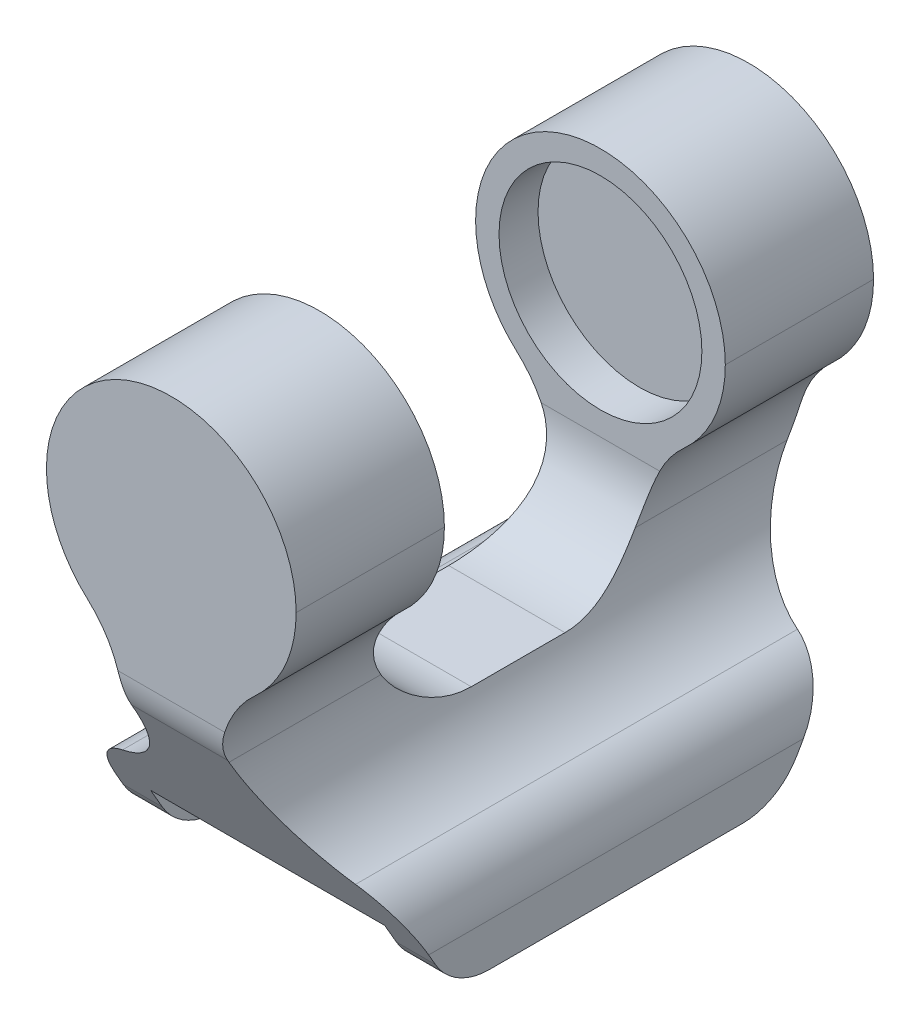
ISO-10303-21;
HEADER;
FILE_DESCRIPTION(('STEP AP214'),'2;1');
FILE_NAME('part.step','',(''),(''),'','','');
FILE_SCHEMA(('AUTOMOTIVE_DESIGN { 1 0 10303 214 1 1 1 1 }'));
ENDSEC;
DATA;
#1=APPLICATION_CONTEXT('core data for automotive mechanical design processes');
#2=APPLICATION_PROTOCOL_DEFINITION('international standard','automotive_design',2000,#1);
#3=PRODUCT_CONTEXT('',#1,'mechanical');
#4=PRODUCT('Part','Part','',(#3));
#5=PRODUCT_RELATED_PRODUCT_CATEGORY('part','',(#4));
#6=PRODUCT_DEFINITION_FORMATION('','',#4);
#7=PRODUCT_DEFINITION_CONTEXT('part definition',#1,'design');
#8=PRODUCT_DEFINITION('design','',#6,#7);
#9=PRODUCT_DEFINITION_SHAPE('','',#8);
#10=(LENGTH_UNIT() NAMED_UNIT(*) SI_UNIT(.MILLI.,.METRE.));
#11=(NAMED_UNIT(*) PLANE_ANGLE_UNIT() SI_UNIT($,.RADIAN.));
#12=(NAMED_UNIT(*) SI_UNIT($,.STERADIAN.) SOLID_ANGLE_UNIT());
#13=UNCERTAINTY_MEASURE_WITH_UNIT(LENGTH_MEASURE(1.E-05),#10,'distance_accuracy_value','');
#14=(GEOMETRIC_REPRESENTATION_CONTEXT(3) GLOBAL_UNCERTAINTY_ASSIGNED_CONTEXT((#13)) GLOBAL_UNIT_ASSIGNED_CONTEXT((#10,
#11,#12)) REPRESENTATION_CONTEXT('',''));
#15=CARTESIAN_POINT('',(0.,0.,0.));
#16=DIRECTION('',(0.,0.,1.));
#17=DIRECTION('',(1.,0.,0.));
#18=AXIS2_PLACEMENT_3D('',#15,#16,#17);
#19=CARTESIAN_POINT('',(-0.0020769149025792,-850.241128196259,-37.6200664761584));
#20=DIRECTION('',(0.,-1.,0.));
#21=DIRECTION('',(0.896640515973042,0.,-0.442759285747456));
#22=AXIS2_PLACEMENT_3D('',#19,#20,#21);
#23=CYLINDRICAL_SURFACE('',#22,2.75);
#24=CARTESIAN_POINT('',(-0.0020769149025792,-850.241128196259,-37.6200664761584));
#25=DIRECTION('',(0.,-1.,0.));
#26=DIRECTION('',(0.896640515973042,0.,-0.442759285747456));
#27=AXIS2_PLACEMENT_3D('',#24,#25,#26);
#28=CIRCLE('',#27,2.75);
#29=CARTESIAN_POINT('',(2.46368450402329,-850.241128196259,-38.8376545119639));
#30=VERTEX_POINT('',#29);
#31=EDGE_CURVE('E574',#30,#30,#28,.T.);
#32=ORIENTED_EDGE('',*,*,#31,.T.);
#33=EDGE_LOOP('',(#32));
#34=FACE_BOUND('',#33,.T.);
#35=CARTESIAN_POINT('',(-0.0020769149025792,-853.241128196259,-37.6200664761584));
#36=DIRECTION('',(0.,-1.,0.));
#37=DIRECTION('',(0.896640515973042,0.,-0.442759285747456));
#38=AXIS2_PLACEMENT_3D('',#35,#36,#37);
#39=CIRCLE('',#38,2.75);
#40=CARTESIAN_POINT('',(2.46368450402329,-853.241128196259,-38.8376545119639));
#41=VERTEX_POINT('',#40);
#42=EDGE_CURVE('E572',#41,#41,#39,.F.);
#43=ORIENTED_EDGE('',*,*,#42,.T.);
#44=EDGE_LOOP('',(#43));
#45=FACE_BOUND('',#44,.T.);
#46=ADVANCED_FACE('F16',(#34,#45),#23,.T.);
#47=CARTESIAN_POINT('',(9.99792181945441,-849.541128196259,-45.727763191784));
#48=DIRECTION('',(0.999999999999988,0.,-1.56103906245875E-07));
#49=DIRECTION('',(-1.56103906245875E-07,0.,-0.999999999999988));
#50=AXIS2_PLACEMENT_3D('',#47,#48,#49);
#51=CYLINDRICAL_SURFACE('',#50,4.);
#52=CARTESIAN_POINT('',(7.49792181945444,-849.541128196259,-45.7277628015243));
#53=DIRECTION('',(0.999999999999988,0.,-1.56103905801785E-07));
#54=DIRECTION('',(-1.56103905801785E-07,0.,-0.999999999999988));
#55=AXIS2_PLACEMENT_3D('',#52,#53,#54);
#56=CIRCLE('',#55,4.);
#57=CARTESIAN_POINT('',(7.49792127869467,-851.541128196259,-49.191864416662));
#58=VERTEX_POINT('',#57);
#59=CARTESIAN_POINT('',(7.49792181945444,-853.541128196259,-45.7277628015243));
#60=VERTEX_POINT('',#59);
#61=EDGE_CURVE('E612',#58,#60,#56,.F.);
#62=ORIENTED_EDGE('',*,*,#61,.F.);
#63=DIRECTION('',(-0.999999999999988,0.,1.56103906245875E-07));
#64=VECTOR('',#63,1.);
#65=CARTESIAN_POINT('',(-10.0020787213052,-851.541128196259,-49.1918616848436));
#66=LINE('',#65,#64);
#67=CARTESIAN_POINT('',(9.99792127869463,-851.541128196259,-49.1918648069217));
#68=VERTEX_POINT('',#67);
#69=EDGE_CURVE('E329',#68,#58,#66,.T.);
#70=ORIENTED_EDGE('',*,*,#69,.F.);
#71=CARTESIAN_POINT('',(9.99792181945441,-849.541128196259,-45.727763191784));
#72=DIRECTION('',(0.999999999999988,0.,-1.56103906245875E-07));
#73=DIRECTION('',(1.56103906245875E-07,0.,0.999999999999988));
#74=AXIS2_PLACEMENT_3D('',#71,#72,#73);
#75=CIRCLE('',#74,4.);
#76=CARTESIAN_POINT('',(9.99792181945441,-853.541128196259,-45.727763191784));
#77=VERTEX_POINT('',#76);
#78=EDGE_CURVE('E342',#77,#68,#75,.T.);
#79=ORIENTED_EDGE('',*,*,#78,.F.);
#80=DIRECTION('',(0.999999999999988,0.,-1.56103906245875E-07));
#81=VECTOR('',#80,1.);
#82=CARTESIAN_POINT('',(9.99792181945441,-853.541128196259,-45.727763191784));
#83=LINE('',#82,#81);
#84=EDGE_CURVE('E633',#60,#77,#83,.T.);
#85=ORIENTED_EDGE('',*,*,#84,.F.);
#86=EDGE_LOOP('',(#62,#70,#79,#85));
#87=FACE_BOUND('',#86,.T.);
#88=ADVANCED_FACE('F768',(#87),#51,.T.);
#89=CARTESIAN_POINT('',(9.99792435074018,-849.541128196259,-29.5123728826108));
#90=DIRECTION('',(0.999999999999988,0.,-1.56103906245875E-07));
#91=DIRECTION('',(-1.56103906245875E-07,0.,-0.999999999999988));
#92=AXIS2_PLACEMENT_3D('',#89,#90,#91);
#93=CYLINDRICAL_SURFACE('',#92,4.);
#94=CARTESIAN_POINT('',(7.49792435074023,-849.541128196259,-29.512372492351));
#95=DIRECTION('',(0.999999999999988,0.,-1.56103905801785E-07));
#96=DIRECTION('',(-1.56103905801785E-07,0.,-0.999999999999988));
#97=AXIS2_PLACEMENT_3D('',#94,#95,#96);
#98=CIRCLE('',#97,4.);
#99=CARTESIAN_POINT('',(7.49792435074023,-853.541128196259,-29.512372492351));
#100=VERTEX_POINT('',#99);
#101=CARTESIAN_POINT('',(7.4979248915,-851.541128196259,-26.0482708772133));
#102=VERTEX_POINT('',#101);
#103=EDGE_CURVE('E606',#100,#102,#98,.F.);
#104=ORIENTED_EDGE('',*,*,#103,.F.);
#105=DIRECTION('',(-0.999999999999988,0.,1.56103906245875E-07));
#106=VECTOR('',#105,1.);
#107=CARTESIAN_POINT('',(-10.0020756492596,-853.541128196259,-29.5123697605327));
#108=LINE('',#107,#106);
#109=CARTESIAN_POINT('',(9.99792435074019,-853.541128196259,-29.5123728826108));
#110=VERTEX_POINT('',#109);
#111=EDGE_CURVE('E677',#110,#100,#108,.T.);
#112=ORIENTED_EDGE('',*,*,#111,.F.);
#113=CARTESIAN_POINT('',(9.99792435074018,-849.541128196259,-29.5123728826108));
#114=DIRECTION('',(0.999999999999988,0.,-1.56103906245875E-07));
#115=DIRECTION('',(1.56103906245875E-07,0.,0.999999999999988));
#116=AXIS2_PLACEMENT_3D('',#113,#114,#115);
#117=CIRCLE('',#116,4.);
#118=CARTESIAN_POINT('',(9.99792489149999,-851.541128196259,-26.0482712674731));
#119=VERTEX_POINT('',#118);
#120=EDGE_CURVE('E655',#119,#110,#117,.T.);
#121=ORIENTED_EDGE('',*,*,#120,.F.);
#122=DIRECTION('',(0.999999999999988,0.,-1.56103906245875E-07));
#123=VECTOR('',#122,1.);
#124=CARTESIAN_POINT('',(9.99792489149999,-851.541128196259,-26.0482712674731));
#125=LINE('',#124,#123);
#126=EDGE_CURVE('E315',#102,#119,#125,.T.);
#127=ORIENTED_EDGE('',*,*,#126,.F.);
#128=EDGE_LOOP('',(#104,#112,#121,#127));
#129=FACE_BOUND('',#128,.T.);
#130=ADVANCED_FACE('F757',(#129),#93,.T.);
#131=CARTESIAN_POINT('',(9.99792597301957,-853.541128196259,-19.1200680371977));
#132=DIRECTION('',(0.,1.,0.));
#133=DIRECTION('',(0.999999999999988,0.,-1.56103906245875E-07));
#134=AXIS2_PLACEMENT_3D('',#131,#132,#133);
#135=PLANE('',#134);
#136=ORIENTED_EDGE('',*,*,#111,.T.);
#137=DIRECTION('',(-1.56103905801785E-07,0.,-0.999999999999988));
#138=VECTOR('',#137,1.);
#139=CARTESIAN_POINT('',(7.49792597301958,-853.541128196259,-19.1200676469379));
#140=LINE('',#139,#138);
#141=EDGE_CURVE('E25',#100,#60,#140,.T.);
#142=ORIENTED_EDGE('',*,*,#141,.T.);
#143=ORIENTED_EDGE('',*,*,#84,.T.);
#144=DIRECTION('',(-1.56103906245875E-07,0.,-0.999999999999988));
#145=VECTOR('',#144,1.);
#146=CARTESIAN_POINT('',(9.99792597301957,-853.541128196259,-19.1200680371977));
#147=LINE('',#146,#145);
#148=EDGE_CURVE('E347',#110,#77,#147,.T.);
#149=ORIENTED_EDGE('',*,*,#148,.F.);
#150=EDGE_LOOP('',(#136,#142,#143,#149));
#151=FACE_BOUND('',#150,.T.);
#152=ADVANCED_FACE('F761',(#151),#135,.F.);
#153=CARTESIAN_POINT('',(-10.0020791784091,-838.469331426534,-52.1200649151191));
#154=DIRECTION('',(-0.999999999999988,0.,1.56103906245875E-07));
#155=DIRECTION('',(1.56103906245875E-07,0.,0.999999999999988));
#156=AXIS2_PLACEMENT_3D('',#153,#154,#155);
#157=CYLINDRICAL_SURFACE('',#156,4.);
#158=CARTESIAN_POINT('',(3.07644092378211,-840.469331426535,-55.584168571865));
#159=CARTESIAN_POINT('',(3.07726652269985,-840.430889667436,-55.6063643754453));
#160=CARTESIAN_POINT('',(3.07842105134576,-840.392086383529,-55.6279234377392));
#161=CARTESIAN_POINT('',(3.08141620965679,-840.313931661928,-55.6696676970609));
#162=CARTESIAN_POINT('',(3.08325465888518,-840.274582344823,-55.6898570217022));
#163=CARTESIAN_POINT('',(3.08764619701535,-840.195348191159,-55.7288620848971));
#164=CARTESIAN_POINT('',(3.09019781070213,-840.155464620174,-55.7476805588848));
#165=CARTESIAN_POINT('',(3.09604369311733,-840.075176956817,-55.783945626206));
#166=CARTESIAN_POINT('',(3.09933726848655,-840.034773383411,-55.8013934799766));
#167=CARTESIAN_POINT('',(3.1066953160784,-839.953461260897,-55.8349187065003));
#168=CARTESIAN_POINT('',(3.11075994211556,-839.91255261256,-55.8509958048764));
#169=CARTESIAN_POINT('',(3.11968832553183,-839.830246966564,-55.8817811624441));
#170=CARTESIAN_POINT('',(3.12455313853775,-839.788849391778,-55.8964875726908));
#171=CARTESIAN_POINT('',(3.13511017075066,-839.705583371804,-55.9245328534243));
#172=CARTESIAN_POINT('',(3.14080438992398,-839.663714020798,-55.9378682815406));
#173=CARTESIAN_POINT('',(3.15304844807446,-839.579523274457,-55.9631742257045));
#174=CARTESIAN_POINT('',(3.15960126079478,-839.537200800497,-55.9751397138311));
#175=CARTESIAN_POINT('',(3.17348699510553,-839.45275406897,-55.9975359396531));
#176=CARTESIAN_POINT('',(3.18081124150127,-839.410632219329,-56.0079811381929));
#177=CARTESIAN_POINT('',(3.1963107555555,-839.326173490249,-56.0274788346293));
#178=CARTESIAN_POINT('',(3.20448693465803,-839.283836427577,-56.036529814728));
#179=CARTESIAN_POINT('',(3.22170658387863,-839.198966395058,-56.0532415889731));
#180=CARTESIAN_POINT('',(3.23075187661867,-839.156433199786,-56.0608993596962));
#181=CARTESIAN_POINT('',(3.24972580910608,-839.071190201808,-56.0748259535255));
#182=CARTESIAN_POINT('',(3.25965717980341,-839.028480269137,-56.0810902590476));
#183=CARTESIAN_POINT('',(3.28041904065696,-838.942903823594,-56.0922314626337));
#184=CARTESIAN_POINT('',(3.29125315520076,-838.900037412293,-56.0971023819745));
#185=CARTESIAN_POINT('',(3.31383592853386,-838.814168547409,-56.1054583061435));
#186=CARTESIAN_POINT('',(3.32558907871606,-838.771166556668,-56.1089359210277));
#187=CARTESIAN_POINT('',(3.35002523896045,-838.685047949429,-56.1145063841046));
#188=CARTESIAN_POINT('',(3.36271357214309,-838.641932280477,-56.1165904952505));
#189=CARTESIAN_POINT('',(3.38903430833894,-838.555607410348,-56.1193762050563));
#190=CARTESIAN_POINT('',(3.40267281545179,-838.51239974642,-56.1200678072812));
#191=CARTESIAN_POINT('',(3.41673511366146,-838.469331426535,-56.1200670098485));
#192=B_SPLINE_CURVE_WITH_KNOTS('',3,(#158,#159,#160,#161,#162,#163,#164,#165,#166,#167,#168,
#169,#170,#171,#172,#173,#174,#175,#176,#177,#178,#179,#180,#181,#182,#183,#184,#185,#186,#187,
#188,#189,#190,#191),.UNSPECIFIED.,.F.,.F.,(4,2,2,2,2,2,2,2,2,2,2,2,2,2,2,2,4),(0.,
0.133185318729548,0.265949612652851,0.398441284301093,0.530809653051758,0.663204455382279,
0.795775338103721,0.928671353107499,1.06204046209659,1.19404390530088,1.32619005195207,
1.45861963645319,1.59147249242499,1.72488712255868,1.85900028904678,1.99394663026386,
2.12985830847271),.UNSPECIFIED.);
#193=CARTESIAN_POINT('',(3.0764409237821,-840.469331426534,-55.584168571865));
#194=VERTEX_POINT('',#193);
#195=CARTESIAN_POINT('',(3.41673511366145,-838.469331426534,-56.1200670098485));
#196=VERTEX_POINT('',#195);
#197=EDGE_CURVE('E870',#194,#196,#192,.T.);
#198=ORIENTED_EDGE('',*,*,#197,.F.);
#199=DIRECTION('',(0.999999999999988,0.,-1.56103906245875E-07));
#200=VECTOR('',#199,1.);
#201=CARTESIAN_POINT('',(3.15911696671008,-840.469331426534,-55.584168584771));
#202=LINE('',#201,#200);
#203=CARTESIAN_POINT('',(-3.08060036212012,-840.469331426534,-55.5841676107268));
#204=VERTEX_POINT('',#203);
#205=EDGE_CURVE('E333',#204,#194,#202,.T.);
#206=ORIENTED_EDGE('',*,*,#205,.F.);
#207=CARTESIAN_POINT('',(-3.42089471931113,-838.469331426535,-56.1200659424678));
#208=CARTESIAN_POINT('',(-3.40691032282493,-838.51216119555,-56.1200667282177));
#209=CARTESIAN_POINT('',(-3.39334502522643,-838.555128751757,-56.119382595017));
#210=CARTESIAN_POINT('',(-3.36715974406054,-838.640975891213,-56.116627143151));
#211=CARTESIAN_POINT('',(-3.35453378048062,-838.683853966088,-56.114565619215));
#212=CARTESIAN_POINT('',(-3.33021174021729,-838.769500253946,-56.1090556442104));
#213=CARTESIAN_POINT('',(-3.31851044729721,-838.812267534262,-56.1056157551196));
#214=CARTESIAN_POINT('',(-3.29602113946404,-838.89767023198,-56.0973505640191));
#215=CARTESIAN_POINT('',(-3.28522872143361,-838.940305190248,-56.0925325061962));
#216=CARTESIAN_POINT('',(-3.26454037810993,-839.025422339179,-56.0815122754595));
#217=CARTESIAN_POINT('',(-3.25464089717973,-839.067904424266,-56.0753159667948));
#218=CARTESIAN_POINT('',(-3.2357212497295,-839.152695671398,-56.0615405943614));
#219=CARTESIAN_POINT('',(-3.22669840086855,-839.195004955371,-56.0539659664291));
#220=CARTESIAN_POINT('',(-3.20951453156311,-839.279431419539,-56.0374356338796));
#221=CARTESIAN_POINT('',(-3.20135171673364,-839.321548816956,-56.0284829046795));
#222=CARTESIAN_POINT('',(-3.18587021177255,-839.405572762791,-56.0091969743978));
#223=CARTESIAN_POINT('',(-3.17855061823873,-839.447479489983,-55.9988652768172));
#224=CARTESIAN_POINT('',(-3.16459061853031,-839.531953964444,-55.9765919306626));
#225=CARTESIAN_POINT('',(-3.15796792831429,-839.574516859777,-55.9646207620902));
#226=CARTESIAN_POINT('',(-3.14559417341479,-839.659185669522,-55.9392876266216));
#227=CARTESIAN_POINT('',(-3.13984008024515,-839.701292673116,-55.9259307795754));
#228=CARTESIAN_POINT('',(-3.12917293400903,-839.785030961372,-55.8978269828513));
#229=CARTESIAN_POINT('',(-3.12425784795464,-839.826663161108,-55.8830835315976));
#230=CARTESIAN_POINT('',(-3.1152381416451,-839.90943470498,-55.8522084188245));
#231=CARTESIAN_POINT('',(-3.11113245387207,-839.950574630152,-55.8360786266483));
#232=CARTESIAN_POINT('',(-3.10370109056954,-840.032345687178,-55.8024323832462));
#233=CARTESIAN_POINT('',(-3.10037526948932,-840.072976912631,-55.7849161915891));
#234=CARTESIAN_POINT('',(-3.09447328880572,-840.153716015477,-55.7484988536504));
#235=CARTESIAN_POINT('',(-3.09189784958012,-840.193823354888,-55.7295963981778));
#236=CARTESIAN_POINT('',(-3.08746664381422,-840.27350095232,-55.6904078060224));
#237=CARTESIAN_POINT('',(-3.08561239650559,-840.313069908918,-55.6701188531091));
#238=CARTESIAN_POINT('',(-3.08259320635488,-840.391659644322,-55.6281598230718));
#239=CARTESIAN_POINT('',(-3.08143050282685,-840.430678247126,-55.6064855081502));
#240=CARTESIAN_POINT('',(-3.08060036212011,-840.469331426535,-55.5841676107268));
#241=B_SPLINE_CURVE_WITH_KNOTS('',3,(#207,#208,#209,#210,#211,#212,#213,#214,#215,#216,#217,
#218,#219,#220,#221,#222,#223,#224,#225,#226,#227,#228,#229,#230,#231,#232,#233,#234,#235,#236,
#237,#238,#239,#240),.UNSPECIFIED.,.F.,.F.,(4,2,2,2,2,2,2,2,2,2,2,2,2,2,2,2,4),(0.,
0.135158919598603,0.269366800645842,0.402753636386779,0.535451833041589,0.667595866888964,
0.799321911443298,0.930767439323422,1.06207080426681,1.19616144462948,1.32977318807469,
1.46305643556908,1.59616270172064,1.72924410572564,1.86245285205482,1.99594070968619,
2.12985849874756),.UNSPECIFIED.);
#242=CARTESIAN_POINT('',(-3.42089471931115,-838.469331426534,-56.1200659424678));
#243=VERTEX_POINT('',#242);
#244=EDGE_CURVE('E358',#243,#204,#241,.T.);
#245=ORIENTED_EDGE('',*,*,#244,.F.);
#246=DIRECTION('',(-0.999999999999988,0.,1.56103906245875E-07));
#247=VECTOR('',#246,1.);
#248=CARTESIAN_POINT('',(-3.16327648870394,-838.469331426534,-56.120065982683));
#249=LINE('',#248,#247);
#250=EDGE_CURVE('E120',#196,#243,#249,.T.);
#251=ORIENTED_EDGE('',*,*,#250,.F.);
#252=EDGE_LOOP('',(#198,#206,#245,#251));
#253=FACE_BOUND('',#252,.T.);
#254=ADVANCED_FACE('F913',(#253),#157,.T.);
#255=CARTESIAN_POINT('',(-7.50207818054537,-849.541128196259,-45.7277604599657));
#256=DIRECTION('',(-0.999999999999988,0.,1.56103905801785E-07));
#257=DIRECTION('',(1.56103905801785E-07,0.,0.999999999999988));
#258=AXIS2_PLACEMENT_3D('',#255,#256,#257);
#259=CIRCLE('',#258,4.);
#260=CARTESIAN_POINT('',(-7.50207818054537,-853.541128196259,-45.7277604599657));
#261=VERTEX_POINT('',#260);
#262=CARTESIAN_POINT('',(-7.50207872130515,-851.541128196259,-49.1918620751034));
#263=VERTEX_POINT('',#262);
#264=EDGE_CURVE('E600',#261,#263,#259,.F.);
#265=ORIENTED_EDGE('',*,*,#264,.F.);
#266=CARTESIAN_POINT('',(-10.0020781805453,-853.541128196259,-45.7277600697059));
#267=VERTEX_POINT('',#266);
#268=EDGE_CURVE('E625',#267,#261,#83,.T.);
#269=ORIENTED_EDGE('',*,*,#268,.F.);
#270=CARTESIAN_POINT('',(-10.0020781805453,-849.541128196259,-45.7277600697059));
#271=DIRECTION('',(-0.999999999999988,0.,1.56103906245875E-07));
#272=DIRECTION('',(-1.56103906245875E-07,0.,-0.999999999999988));
#273=AXIS2_PLACEMENT_3D('',#270,#271,#272);
#274=CIRCLE('',#273,4.);
#275=CARTESIAN_POINT('',(-10.0020787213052,-851.541128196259,-49.1918616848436));
#276=VERTEX_POINT('',#275);
#277=EDGE_CURVE('E646',#276,#267,#274,.T.);
#278=ORIENTED_EDGE('',*,*,#277,.F.);
#279=EDGE_CURVE('E47',#263,#276,#66,.T.);
#280=ORIENTED_EDGE('',*,*,#279,.F.);
#281=EDGE_LOOP('',(#265,#269,#278,#280));
#282=FACE_BOUND('',#281,.T.);
#283=ADVANCED_FACE('F379',(#282),#51,.T.);
#284=CARTESIAN_POINT('',(-7.50207564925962,-849.541128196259,-29.5123701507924));
#285=DIRECTION('',(-0.999999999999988,0.,1.56103905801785E-07));
#286=DIRECTION('',(1.56103905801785E-07,0.,0.999999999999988));
#287=AXIS2_PLACEMENT_3D('',#284,#285,#286);
#288=CIRCLE('',#287,4.);
#289=CARTESIAN_POINT('',(-7.50207510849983,-851.541128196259,-26.0482685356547));
#290=VERTEX_POINT('',#289);
#291=CARTESIAN_POINT('',(-7.50207564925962,-853.541128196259,-29.5123701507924));
#292=VERTEX_POINT('',#291);
#293=EDGE_CURVE('E33',#290,#292,#288,.F.);
#294=ORIENTED_EDGE('',*,*,#293,.F.);
#295=CARTESIAN_POINT('',(-10.0020751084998,-851.541128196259,-26.048268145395));
#296=VERTEX_POINT('',#295);
#297=EDGE_CURVE('E312',#296,#290,#125,.T.);
#298=ORIENTED_EDGE('',*,*,#297,.F.);
#299=CARTESIAN_POINT('',(-10.0020756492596,-849.541128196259,-29.5123697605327));
#300=DIRECTION('',(-0.999999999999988,0.,1.56103906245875E-07));
#301=DIRECTION('',(-1.56103906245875E-07,0.,-0.999999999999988));
#302=AXIS2_PLACEMENT_3D('',#299,#300,#301);
#303=CIRCLE('',#302,4.);
#304=CARTESIAN_POINT('',(-10.0020756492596,-853.541128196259,-29.5123697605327));
#305=VERTEX_POINT('',#304);
#306=EDGE_CURVE('E320',#305,#296,#303,.T.);
#307=ORIENTED_EDGE('',*,*,#306,.F.);
#308=EDGE_CURVE('E681',#292,#305,#108,.T.);
#309=ORIENTED_EDGE('',*,*,#308,.F.);
#310=EDGE_LOOP('',(#294,#298,#307,#309));
#311=FACE_BOUND('',#310,.T.);
#312=ADVANCED_FACE('F895',(#311),#93,.T.);
#313=CARTESIAN_POINT('',(-10.0020746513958,-838.469331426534,-23.1200649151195));
#314=DIRECTION('',(0.999999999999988,0.,-1.56103906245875E-07));
#315=DIRECTION('',(-1.56103906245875E-07,0.,-0.999999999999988));
#316=AXIS2_PLACEMENT_3D('',#313,#314,#315);
#317=CYLINDRICAL_SURFACE('',#316,4.);
#318=CARTESIAN_POINT('',(-3.08059475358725,-840.469331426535,-19.6559643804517));
#319=CARTESIAN_POINT('',(-3.08142035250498,-840.430889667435,-19.6337685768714));
#320=CARTESIAN_POINT('',(-3.0825748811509,-840.392086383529,-19.6122095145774));
#321=CARTESIAN_POINT('',(-3.08557003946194,-840.313931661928,-19.5704652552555));
#322=CARTESIAN_POINT('',(-3.08740848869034,-840.274582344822,-19.5502759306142));
#323=CARTESIAN_POINT('',(-3.09180002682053,-840.195348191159,-19.5112708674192));
#324=CARTESIAN_POINT('',(-3.09435164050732,-840.155464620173,-19.4924523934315));
#325=CARTESIAN_POINT('',(-3.10019752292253,-840.075176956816,-19.4561873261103));
#326=CARTESIAN_POINT('',(-3.10349109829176,-840.03477338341,-19.4387394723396));
#327=CARTESIAN_POINT('',(-3.11084914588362,-839.953461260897,-19.4052142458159));
#328=CARTESIAN_POINT('',(-3.11491377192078,-839.912552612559,-19.3891371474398));
#329=CARTESIAN_POINT('',(-3.12384215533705,-839.830246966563,-19.3583517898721));
#330=CARTESIAN_POINT('',(-3.12870696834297,-839.788849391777,-19.3436453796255));
#331=CARTESIAN_POINT('',(-3.13926400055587,-839.705583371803,-19.3156000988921));
#332=CARTESIAN_POINT('',(-3.14495821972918,-839.663714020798,-19.3022646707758));
#333=CARTESIAN_POINT('',(-3.15720227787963,-839.579523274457,-19.2769587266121));
#334=CARTESIAN_POINT('',(-3.16375509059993,-839.537200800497,-19.2649932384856));
#335=CARTESIAN_POINT('',(-3.1776408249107,-839.45275406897,-19.2425970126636));
#336=CARTESIAN_POINT('',(-3.18496507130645,-839.410632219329,-19.2321518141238));
#337=CARTESIAN_POINT('',(-3.20046458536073,-839.326173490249,-19.2126541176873));
#338=CARTESIAN_POINT('',(-3.20864076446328,-839.283836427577,-19.2036031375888));
#339=CARTESIAN_POINT('',(-3.22586041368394,-839.198966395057,-19.1868913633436));
#340=CARTESIAN_POINT('',(-3.234905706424,-839.156433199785,-19.1792335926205));
#341=CARTESIAN_POINT('',(-3.25387963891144,-839.071190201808,-19.1653069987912));
#342=CARTESIAN_POINT('',(-3.26381100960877,-839.028480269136,-19.159042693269));
#343=CARTESIAN_POINT('',(-3.28457287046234,-838.942903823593,-19.147901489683));
#344=CARTESIAN_POINT('',(-3.29540698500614,-838.900037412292,-19.1430305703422));
#345=CARTESIAN_POINT('',(-3.31798975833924,-838.814168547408,-19.1346746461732));
#346=CARTESIAN_POINT('',(-3.32974290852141,-838.771166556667,-19.131197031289));
#347=CARTESIAN_POINT('',(-3.35417906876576,-838.685047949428,-19.1256265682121));
#348=CARTESIAN_POINT('',(-3.36686740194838,-838.641932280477,-19.1235424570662));
#349=CARTESIAN_POINT('',(-3.39318813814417,-838.555607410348,-19.1207567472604));
#350=CARTESIAN_POINT('',(-3.40682664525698,-838.51239974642,-19.1200651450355));
#351=CARTESIAN_POINT('',(-3.4208889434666,-838.469331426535,-19.1200659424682));
#352=B_SPLINE_CURVE_WITH_KNOTS('',3,(#318,#319,#320,#321,#322,#323,#324,#325,#326,#327,#328,
#329,#330,#331,#332,#333,#334,#335,#336,#337,#338,#339,#340,#341,#342,#343,#344,#345,#346,#347,
#348,#349,#350,#351),.UNSPECIFIED.,.F.,.F.,(4,2,2,2,2,2,2,2,2,2,2,2,2,2,2,2,4),(0.,
0.133185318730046,0.265949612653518,0.398441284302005,0.530809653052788,0.663204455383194,
0.795775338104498,0.928671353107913,1.06204046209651,1.19404390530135,1.32619005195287,
1.45861963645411,1.59147249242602,1.7248871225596,1.85900028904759,1.99394663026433,
2.12985830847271),.UNSPECIFIED.);
#353=CARTESIAN_POINT('',(-3.08059475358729,-840.469331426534,-19.6559643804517));
#354=VERTEX_POINT('',#353);
#355=CARTESIAN_POINT('',(-3.42088894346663,-838.469331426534,-19.1200659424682));
#356=VERTEX_POINT('',#355);
#357=EDGE_CURVE('E795',#354,#356,#352,.T.);
#358=ORIENTED_EDGE('',*,*,#357,.F.);
#359=DIRECTION('',(-0.999999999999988,0.,1.56103906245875E-07));
#360=VECTOR('',#359,1.);
#361=CARTESIAN_POINT('',(-10.002074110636,-840.469331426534,-19.6559632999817));
#362=LINE('',#361,#360);
#363=CARTESIAN_POINT('',(3.07644653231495,-840.469331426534,-19.6559653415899));
#364=VERTEX_POINT('',#363);
#365=EDGE_CURVE('E706',#364,#354,#362,.T.);
#366=ORIENTED_EDGE('',*,*,#365,.F.);
#367=CARTESIAN_POINT('',(3.41674088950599,-838.469331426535,-19.1200670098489));
#368=CARTESIAN_POINT('',(3.40275649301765,-838.512161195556,-19.120066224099));
#369=CARTESIAN_POINT('',(3.38919119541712,-838.55512875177,-19.1207503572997));
#370=CARTESIAN_POINT('',(3.36300591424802,-838.640975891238,-19.1235058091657));
#371=CARTESIAN_POINT('',(3.35037995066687,-838.683853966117,-19.1255673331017));
#372=CARTESIAN_POINT('',(3.32605791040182,-838.769500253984,-19.1310773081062));
#373=CARTESIAN_POINT('',(3.31435661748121,-838.812267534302,-19.134517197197));
#374=CARTESIAN_POINT('',(3.29186730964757,-838.897670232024,-19.1427823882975));
#375=CARTESIAN_POINT('',(3.28107489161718,-838.940305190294,-19.1476004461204));
#376=CARTESIAN_POINT('',(3.26038654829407,-839.025422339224,-19.1586206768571));
#377=CARTESIAN_POINT('',(3.25048706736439,-839.06790442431,-19.1648169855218));
#378=CARTESIAN_POINT('',(3.23156741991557,-839.152695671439,-19.1785923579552));
#379=CARTESIAN_POINT('',(3.22254457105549,-839.195004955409,-19.1861669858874));
#380=CARTESIAN_POINT('',(3.20536070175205,-839.279431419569,-19.2026973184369));
#381=CARTESIAN_POINT('',(3.1971978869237,-839.321548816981,-19.211650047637));
#382=CARTESIAN_POINT('',(3.18171638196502,-839.405572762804,-19.2309359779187));
#383=CARTESIAN_POINT('',(3.17439678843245,-839.44747948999,-19.2412676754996));
#384=CARTESIAN_POINT('',(3.16043678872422,-839.531953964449,-19.2635410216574));
#385=CARTESIAN_POINT('',(3.15381409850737,-839.574516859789,-19.2755121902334));
#386=CARTESIAN_POINT('',(3.14144034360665,-839.659185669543,-19.3008453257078));
#387=CARTESIAN_POINT('',(3.13568625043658,-839.701292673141,-19.3142021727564));
#388=CARTESIAN_POINT('',(3.12501910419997,-839.785030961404,-19.3423059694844));
#389=CARTESIAN_POINT('',(3.12010401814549,-839.826663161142,-19.3570494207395));
#390=CARTESIAN_POINT('',(3.11108431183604,-839.909434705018,-19.3879245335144));
#391=CARTESIAN_POINT('',(3.10697862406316,-839.950574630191,-19.4040543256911));
#392=CARTESIAN_POINT('',(3.09954726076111,-840.032345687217,-19.4377005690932));
#393=CARTESIAN_POINT('',(3.09622143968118,-840.072976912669,-19.4552167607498));
#394=CARTESIAN_POINT('',(3.09031945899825,-840.153716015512,-19.4916340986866));
#395=CARTESIAN_POINT('',(3.08774401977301,-840.19382335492,-19.5105365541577));
#396=CARTESIAN_POINT('',(3.08331281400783,-840.273500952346,-19.5497251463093));
#397=CARTESIAN_POINT('',(3.08145856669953,-840.313069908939,-19.5700140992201));
#398=CARTESIAN_POINT('',(3.07843937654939,-840.391659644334,-19.6119731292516));
#399=CARTESIAN_POINT('',(3.07727667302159,-840.430678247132,-19.6336474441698));
#400=CARTESIAN_POINT('',(3.07644653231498,-840.469331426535,-19.6559653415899));
#401=B_SPLINE_CURVE_WITH_KNOTS('',3,(#367,#368,#369,#370,#371,#372,#373,#374,#375,#376,#377,
#378,#379,#380,#381,#382,#383,#384,#385,#386,#387,#388,#389,#390,#391,#392,#393,#394,#395,#396,
#397,#398,#399,#400),.UNSPECIFIED.,.F.,.F.,(4,2,2,2,2,2,2,2,2,2,2,2,2,2,2,2,4),(0.,
0.13515891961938,0.269366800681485,0.402753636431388,0.535451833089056,0.66759586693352,
0.799321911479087,0.93076743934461,1.06207080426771,1.19616144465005,1.32977318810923,
1.46305643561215,1.59616270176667,1.72924410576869,1.86245285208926,1.99594070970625,
2.12985849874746),.UNSPECIFIED.);
#402=CARTESIAN_POINT('',(3.41674088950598,-838.469331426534,-19.1200670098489));
#403=VERTEX_POINT('',#402);
#404=EDGE_CURVE('E522',#403,#364,#401,.T.);
#405=ORIENTED_EDGE('',*,*,#404,.F.);
#406=DIRECTION('',(0.999999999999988,0.,-1.56103906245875E-07));
#407=VECTOR('',#406,1.);
#408=CARTESIAN_POINT('',(-10.0020740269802,-838.469331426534,-19.1200649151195));
#409=LINE('',#408,#407);
#410=EDGE_CURVE('E694',#356,#403,#409,.T.);
#411=ORIENTED_EDGE('',*,*,#410,.F.);
#412=EDGE_LOOP('',(#358,#366,#405,#411));
#413=FACE_BOUND('',#412,.T.);
#414=ADVANCED_FACE('F538',(#413),#317,.T.);
#415=CARTESIAN_POINT('',(9.99792145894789,-853.541128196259,-48.0371642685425));
#416=DIRECTION('',(1.35189948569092E-07,0.5,0.86602540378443));
#417=DIRECTION('',(0.999999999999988,0.,-1.56103906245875E-07));
#418=AXIS2_PLACEMENT_3D('',#415,#416,#417);
#419=PLANE('',#418);
#420=ORIENTED_EDGE('',*,*,#69,.T.);
#421=DIRECTION('',(-7.8051953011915E-08,0.866025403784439,-0.499999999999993));
#422=VECTOR('',#421,1.);
#423=CARTESIAN_POINT('',(7.49792145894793,-853.541128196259,-48.0371638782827));
#424=LINE('',#423,#422);
#425=CARTESIAN_POINT('',(7.49792116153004,-850.241128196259,-49.9424197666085));
#426=VERTEX_POINT('',#425);
#427=EDGE_CURVE('E609',#58,#426,#424,.T.);
#428=ORIENTED_EDGE('',*,*,#427,.T.);
#429=DIRECTION('',(-0.999999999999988,0.,1.56103906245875E-07));
#430=VECTOR('',#429,1.);
#431=CARTESIAN_POINT('',(9.99792116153,-850.241128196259,-49.9424201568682));
#432=LINE('',#431,#430);
#433=CARTESIAN_POINT('',(-7.50207883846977,-850.241128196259,-49.9424174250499));
#434=VERTEX_POINT('',#433);
#435=EDGE_CURVE('E319',#426,#434,#432,.T.);
#436=ORIENTED_EDGE('',*,*,#435,.T.);
#437=DIRECTION('',(7.8051953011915E-08,-0.866025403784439,0.499999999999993));
#438=VECTOR('',#437,1.);
#439=CARTESIAN_POINT('',(-7.50207854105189,-853.541128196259,-48.0371615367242));
#440=LINE('',#439,#438);
#441=EDGE_CURVE('E598',#434,#263,#440,.T.);
#442=ORIENTED_EDGE('',*,*,#441,.T.);
#443=ORIENTED_EDGE('',*,*,#279,.T.);
#444=DIRECTION('',(7.80519532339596E-08,-0.86602540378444,0.499999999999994));
#445=VECTOR('',#444,1.);
#446=CARTESIAN_POINT('',(-10.0020785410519,-853.541128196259,-48.0371611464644));
#447=LINE('',#446,#445);
#448=CARTESIAN_POINT('',(-10.0020787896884,-850.782381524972,-49.6299242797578));
#449=VERTEX_POINT('',#448);
#450=EDGE_CURVE('E642',#449,#276,#447,.T.);
#451=ORIENTED_EDGE('',*,*,#450,.F.);
#452=CARTESIAN_POINT('',(-7.46686785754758,-847.060232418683,-51.7789084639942));
#453=CARTESIAN_POINT('',(-9.04647579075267,-847.681860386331,-51.420011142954));
#454=CARTESIAN_POINT('',(-10.0020789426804,-849.084858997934,-50.6099893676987));
#455=CARTESIAN_POINT('',(-10.0020787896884,-850.782381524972,-49.6299242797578));
#456=(BOUNDED_CURVE() B_SPLINE_CURVE(3,(#452,#453,#454,#455),.UNSPECIFIED.,.F.,
.F.) B_SPLINE_CURVE_WITH_KNOTS((4,4),(0.374919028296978,1.5707963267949),
.UNSPECIFIED.) CURVE() GEOMETRIC_REPRESENTATION_ITEM() RATIONAL_B_SPLINE_CURVE((1.,
0.884331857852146,0.884331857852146,1.)) REPRESENTATION_ITEM(''));
#457=CARTESIAN_POINT('',(-7.46686785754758,-847.060232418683,-51.7789084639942));
#458=VERTEX_POINT('',#457);
#459=EDGE_CURVE('E666',#458,#449,#456,.T.);
#460=ORIENTED_EDGE('',*,*,#459,.F.);
#461=CARTESIAN_POINT('',(-3.08060036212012,-840.469331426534,-55.5841676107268));
#462=CARTESIAN_POINT('',(-3.01619868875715,-843.466597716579,-53.8536951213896));
#463=CARTESIAN_POINT('',(-4.67715619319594,-845.962388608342,-52.4127493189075));
#464=CARTESIAN_POINT('',(-7.46686785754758,-847.060232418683,-51.7789084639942));
#465=(BOUNDED_CURVE() B_SPLINE_CURVE(3,(#461,#462,#463,#464),.UNSPECIFIED.,.F.,
.F.) B_SPLINE_CURVE_WITH_KNOTS((4,4),(1.54931291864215,2.76667362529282),
.UNSPECIFIED.) CURVE() GEOMETRIC_REPRESENTATION_ITEM() RATIONAL_B_SPLINE_CURVE((1.,
0.880268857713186,0.880268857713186,1.)) REPRESENTATION_ITEM(''));
#466=EDGE_CURVE('E311',#204,#458,#465,.T.);
#467=ORIENTED_EDGE('',*,*,#466,.F.);
#468=ORIENTED_EDGE('',*,*,#205,.T.);
#469=CARTESIAN_POINT('',(3.07484337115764,-840.618051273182,-55.4983051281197));
#470=CARTESIAN_POINT('',(3.07484336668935,-840.568473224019,-55.52692902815));
#471=CARTESIAN_POINT('',(3.07537590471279,-840.518898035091,-55.5555512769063));
#472=CARTESIAN_POINT('',(3.0764409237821,-840.469331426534,-55.584168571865));
#473=(BOUNDED_CURVE() B_SPLINE_CURVE(3,(#469,#470,#471,#472),.UNSPECIFIED.,.F.,
.F.) B_SPLINE_CURVE_WITH_KNOTS((4,4),(4.71238898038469,4.73387238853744),
.UNSPECIFIED.) CURVE() GEOMETRIC_REPRESENTATION_ITEM() RATIONAL_B_SPLINE_CURVE((1.,
0.999961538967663,0.999961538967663,1.)) REPRESENTATION_ITEM(''));
#474=CARTESIAN_POINT('',(3.07484337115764,-840.618051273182,-55.4983051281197));
#475=VERTEX_POINT('',#474);
#476=EDGE_CURVE('E836',#475,#194,#473,.T.);
#477=ORIENTED_EDGE('',*,*,#476,.F.);
#478=CARTESIAN_POINT('',(7.46270960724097,-847.060232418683,-51.7789107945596));
#479=CARTESIAN_POINT('',(4.72877260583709,-845.984337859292,-52.4000783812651));
#480=CARTESIAN_POINT('',(3.07484363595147,-843.556071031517,-53.8020386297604));
#481=CARTESIAN_POINT('',(3.07484337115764,-840.618051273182,-55.4983051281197));
#482=(BOUNDED_CURVE() B_SPLINE_CURVE(3,(#478,#479,#480,#481),.UNSPECIFIED.,.F.,
.F.) B_SPLINE_CURVE_WITH_KNOTS((4,4),(3.51651168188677,4.71238898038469),
.UNSPECIFIED.) CURVE() GEOMETRIC_REPRESENTATION_ITEM() RATIONAL_B_SPLINE_CURVE((1.,
0.884331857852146,0.884331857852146,1.)) REPRESENTATION_ITEM(''));
#483=CARTESIAN_POINT('',(7.46270960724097,-847.060232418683,-51.7789107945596));
#484=VERTEX_POINT('',#483);
#485=EDGE_CURVE('E701',#484,#475,#482,.T.);
#486=ORIENTED_EDGE('',*,*,#485,.F.);
#487=CARTESIAN_POINT('',(9.99792121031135,-850.782381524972,-49.6299274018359));
#488=CARTESIAN_POINT('',(9.99792105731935,-849.084858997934,-50.6099924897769));
#489=CARTESIAN_POINT('',(9.04231765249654,-847.681860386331,-51.4200139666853));
#490=CARTESIAN_POINT('',(7.46270960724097,-847.060232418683,-51.7789107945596));
#491=(BOUNDED_CURVE() B_SPLINE_CURVE(3,(#487,#488,#489,#490),.UNSPECIFIED.,.F.,
.F.) B_SPLINE_CURVE_WITH_KNOTS((4,4),(4.71238898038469,5.90826627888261),
.UNSPECIFIED.) CURVE() GEOMETRIC_REPRESENTATION_ITEM() RATIONAL_B_SPLINE_CURVE((1.,
0.884331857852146,0.884331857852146,1.)) REPRESENTATION_ITEM(''));
#492=CARTESIAN_POINT('',(9.99792121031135,-850.782381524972,-49.6299274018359));
#493=VERTEX_POINT('',#492);
#494=EDGE_CURVE('E667',#493,#484,#491,.T.);
#495=ORIENTED_EDGE('',*,*,#494,.F.);
#496=DIRECTION('',(-7.80519532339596E-08,0.86602540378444,-0.499999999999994));
#497=VECTOR('',#496,1.);
#498=CARTESIAN_POINT('',(9.99792145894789,-853.541128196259,-48.0371642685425));
#499=LINE('',#498,#497);
#500=EDGE_CURVE('E346',#68,#493,#499,.T.);
#501=ORIENTED_EDGE('',*,*,#500,.F.);
#502=EDGE_LOOP('',(#420,#428,#436,#442,#443,#451,#460,#467,#468,#477,#486,#495,#501));
#503=FACE_BOUND('',#502,.T.);
#504=ADVANCED_FACE('F425',(#503),#419,.F.);
#505=CARTESIAN_POINT('',(-10.0020740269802,-839.541128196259,-19.1200649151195));
#506=DIRECTION('',(1.35189948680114E-07,-0.5,0.866025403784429));
#507=DIRECTION('',(-0.999999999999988,0.,1.56103906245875E-07));
#508=AXIS2_PLACEMENT_3D('',#505,#506,#507);
#509=PLANE('',#508);
#510=DIRECTION('',(7.80519527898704E-08,0.866025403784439,0.499999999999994));
#511=VECTOR('',#510,1.);
#512=CARTESIAN_POINT('',(7.49792597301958,-839.541128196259,-19.1200676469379));
#513=LINE('',#512,#511);
#514=CARTESIAN_POINT('',(7.49792500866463,-850.241128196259,-25.2977155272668));
#515=VERTEX_POINT('',#514);
#516=EDGE_CURVE('E603',#102,#515,#513,.T.);
#517=ORIENTED_EDGE('',*,*,#516,.F.);
#518=ORIENTED_EDGE('',*,*,#126,.T.);
#519=DIRECTION('',(-7.8051953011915E-08,-0.86602540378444,-0.499999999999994));
#520=VECTOR('',#519,1.);
#521=CARTESIAN_POINT('',(9.99792597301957,-839.541128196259,-19.1200680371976));
#522=LINE('',#521,#520);
#523=CARTESIAN_POINT('',(9.99792495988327,-850.782381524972,-25.6102086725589));
#524=VERTEX_POINT('',#523);
#525=EDGE_CURVE('E651',#524,#119,#522,.T.);
#526=ORIENTED_EDGE('',*,*,#525,.F.);
#527=CARTESIAN_POINT('',(7.46271402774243,-847.060232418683,-23.4612244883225));
#528=CARTESIAN_POINT('',(9.04232196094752,-847.681860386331,-23.8201218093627));
#529=CARTESIAN_POINT('',(9.99792511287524,-849.084858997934,-24.630143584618));
#530=CARTESIAN_POINT('',(9.99792495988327,-850.782381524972,-25.6102086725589));
#531=(BOUNDED_CURVE() B_SPLINE_CURVE(3,(#527,#528,#529,#530),.UNSPECIFIED.,.F.,
.F.) B_SPLINE_CURVE_WITH_KNOTS((4,4),(3.51651168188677,4.71238898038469),
.UNSPECIFIED.) CURVE() GEOMETRIC_REPRESENTATION_ITEM() RATIONAL_B_SPLINE_CURVE((1.,
0.884331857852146,0.884331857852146,1.)) REPRESENTATION_ITEM(''));
#532=CARTESIAN_POINT('',(7.46271402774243,-847.060232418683,-23.4612244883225));
#533=VERTEX_POINT('',#532);
#534=EDGE_CURVE('E723',#533,#524,#531,.T.);
#535=ORIENTED_EDGE('',*,*,#534,.F.);
#536=CARTESIAN_POINT('',(3.07484895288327,-840.618051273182,-19.7418287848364));
#537=CARTESIAN_POINT('',(3.07484868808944,-843.556071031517,-21.4380952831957));
#538=CARTESIAN_POINT('',(4.72877722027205,-845.984337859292,-22.8400560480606));
#539=CARTESIAN_POINT('',(7.46271402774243,-847.060232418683,-23.4612244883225));
#540=(BOUNDED_CURVE() B_SPLINE_CURVE(3,(#536,#537,#538,#539),.UNSPECIFIED.,.F.,
.F.) B_SPLINE_CURVE_WITH_KNOTS((4,4),(4.71238898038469,5.90826627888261),
.UNSPECIFIED.) CURVE() GEOMETRIC_REPRESENTATION_ITEM() RATIONAL_B_SPLINE_CURVE((1.,
0.884331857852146,0.884331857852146,1.)) REPRESENTATION_ITEM(''));
#541=CARTESIAN_POINT('',(3.07484895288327,-840.618051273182,-19.7418287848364));
#542=VERTEX_POINT('',#541);
#543=EDGE_CURVE('E617',#542,#533,#540,.T.);
#544=ORIENTED_EDGE('',*,*,#543,.F.);
#545=CARTESIAN_POINT('',(3.07644653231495,-840.469331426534,-19.6559653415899));
#546=CARTESIAN_POINT('',(3.07538150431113,-840.518898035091,-19.684582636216));
#547=CARTESIAN_POINT('',(3.07484895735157,-840.568473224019,-19.7132048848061));
#548=CARTESIAN_POINT('',(3.07484895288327,-840.618051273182,-19.7418287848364));
#549=(BOUNDED_CURVE() B_SPLINE_CURVE(3,(#545,#546,#547,#548),.UNSPECIFIED.,.F.,
.F.) B_SPLINE_CURVE_WITH_KNOTS((4,4),(4.69090557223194,4.71238898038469),
.UNSPECIFIED.) CURVE() GEOMETRIC_REPRESENTATION_ITEM() RATIONAL_B_SPLINE_CURVE((1.,
0.999961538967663,0.999961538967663,1.)) REPRESENTATION_ITEM(''));
#550=EDGE_CURVE('E455',#364,#542,#549,.T.);
#551=ORIENTED_EDGE('',*,*,#550,.F.);
#552=ORIENTED_EDGE('',*,*,#365,.T.);
#553=CARTESIAN_POINT('',(-7.46686343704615,-847.060232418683,-23.4612221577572));
#554=CARTESIAN_POINT('',(-4.67715157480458,-845.962388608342,-22.8273821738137));
#555=CARTESIAN_POINT('',(-3.01619362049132,-843.46659771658,-21.3864368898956));
#556=CARTESIAN_POINT('',(-3.08059475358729,-840.469331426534,-19.6559643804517));
#557=(BOUNDED_CURVE() B_SPLINE_CURVE(3,(#553,#554,#555,#556),.UNSPECIFIED.,.F.,
.F.) B_SPLINE_CURVE_WITH_KNOTS((4,4),(0.374919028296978,1.59227973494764),
.UNSPECIFIED.) CURVE() GEOMETRIC_REPRESENTATION_ITEM() RATIONAL_B_SPLINE_CURVE((1.,
0.880268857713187,0.880268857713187,1.)) REPRESENTATION_ITEM(''));
#558=CARTESIAN_POINT('',(-7.46686343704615,-847.060232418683,-23.4612221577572));
#559=VERTEX_POINT('',#558);
#560=EDGE_CURVE('E660',#559,#354,#557,.T.);
#561=ORIENTED_EDGE('',*,*,#560,.F.);
#562=CARTESIAN_POINT('',(-10.0020750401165,-850.782381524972,-25.6102055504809));
#563=CARTESIAN_POINT('',(-10.0020748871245,-849.084858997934,-24.6301404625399));
#564=CARTESIAN_POINT('',(-9.04647148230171,-847.681860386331,-23.8201189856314));
#565=CARTESIAN_POINT('',(-7.46686343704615,-847.060232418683,-23.4612221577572));
#566=(BOUNDED_CURVE() B_SPLINE_CURVE(3,(#562,#563,#564,#565),.UNSPECIFIED.,.F.,
.F.) B_SPLINE_CURVE_WITH_KNOTS((4,4),(1.5707963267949,2.76667362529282),
.UNSPECIFIED.) CURVE() GEOMETRIC_REPRESENTATION_ITEM() RATIONAL_B_SPLINE_CURVE((1.,
0.884331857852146,0.884331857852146,1.)) REPRESENTATION_ITEM(''));
#567=CARTESIAN_POINT('',(-10.0020750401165,-850.782381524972,-25.6102055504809));
#568=VERTEX_POINT('',#567);
#569=EDGE_CURVE('E661',#568,#559,#566,.T.);
#570=ORIENTED_EDGE('',*,*,#569,.F.);
#571=DIRECTION('',(7.8051953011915E-08,0.86602540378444,0.499999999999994));
#572=VECTOR('',#571,1.);
#573=CARTESIAN_POINT('',(-10.0020740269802,-839.541128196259,-19.1200649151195));
#574=LINE('',#573,#572);
#575=EDGE_CURVE('E323',#296,#568,#574,.T.);
#576=ORIENTED_EDGE('',*,*,#575,.F.);
#577=ORIENTED_EDGE('',*,*,#297,.T.);
#578=DIRECTION('',(-7.80519527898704E-08,-0.866025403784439,-0.499999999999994));
#579=VECTOR('',#578,1.);
#580=CARTESIAN_POINT('',(-7.50207402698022,-839.541128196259,-19.1200653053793));
#581=LINE('',#580,#579);
#582=CARTESIAN_POINT('',(-7.50207499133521,-850.241128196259,-25.2977131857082));
#583=VERTEX_POINT('',#582);
#584=EDGE_CURVE('E595',#583,#290,#581,.T.);
#585=ORIENTED_EDGE('',*,*,#584,.F.);
#586=DIRECTION('',(-0.999999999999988,0.,1.56103906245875E-07));
#587=VECTOR('',#586,1.);
#588=CARTESIAN_POINT('',(-10.0020749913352,-850.241128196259,-25.2977127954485));
#589=LINE('',#588,#587);
#590=EDGE_CURVE('E10',#515,#583,#589,.T.);
#591=ORIENTED_EDGE('',*,*,#590,.F.);
#592=EDGE_LOOP('',(#517,#518,#526,#535,#544,#551,#552,#561,#570,#576,#577,#585,#591));
#593=FACE_BOUND('',#592,.T.);
#594=ADVANCED_FACE('F18',(#593),#509,.T.);
#595=CARTESIAN_POINT('',(-6.00207402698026,-850.782381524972,-19.1200655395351));
#596=DIRECTION('',(-1.56103906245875E-07,0.,-0.999999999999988));
#597=DIRECTION('',(-0.999999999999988,0.,1.56103906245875E-07));
#598=AXIS2_PLACEMENT_3D('',#595,#596,#597);
#599=CYLINDRICAL_SURFACE('',#598,4.);
#600=DIRECTION('',(-1.56103906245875E-07,0.,-0.999999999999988));
#601=VECTOR('',#600,1.);
#602=CARTESIAN_POINT('',(-10.0020740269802,-850.782381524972,-19.1200649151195));
#603=LINE('',#602,#601);
#604=EDGE_CURVE('E328',#568,#449,#603,.T.);
#605=ORIENTED_EDGE('',*,*,#604,.F.);
#606=ORIENTED_EDGE('',*,*,#569,.T.);
#607=DIRECTION('',(1.56103906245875E-07,0.,0.999999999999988));
#608=VECTOR('',#607,1.);
#609=CARTESIAN_POINT('',(-7.46686275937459,-847.060232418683,-19.1200653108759));
#610=LINE('',#609,#608);
#611=EDGE_CURVE('E306',#458,#559,#610,.T.);
#612=ORIENTED_EDGE('',*,*,#611,.F.);
#613=ORIENTED_EDGE('',*,*,#459,.T.);
#614=EDGE_LOOP('',(#605,#606,#612,#613));
#615=FACE_BOUND('',#614,.T.);
#616=ADVANCED_FACE('F1007',(#615),#599,.T.);
#617=CARTESIAN_POINT('',(5.99792597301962,-850.782381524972,-19.120067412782));
#618=DIRECTION('',(-1.56103906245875E-07,0.,-0.999999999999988));
#619=DIRECTION('',(-0.999999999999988,0.,1.56103906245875E-07));
#620=AXIS2_PLACEMENT_3D('',#617,#618,#619);
#621=CYLINDRICAL_SURFACE('',#620,4.);
#622=DIRECTION('',(-1.56103906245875E-07,0.,-0.999999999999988));
#623=VECTOR('',#622,1.);
#624=CARTESIAN_POINT('',(7.46271470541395,-847.060232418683,-19.1200676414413));
#625=LINE('',#624,#623);
#626=EDGE_CURVE('E623',#533,#484,#625,.T.);
#627=ORIENTED_EDGE('',*,*,#626,.F.);
#628=ORIENTED_EDGE('',*,*,#534,.T.);
#629=DIRECTION('',(1.56103906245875E-07,0.,0.999999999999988));
#630=VECTOR('',#629,1.);
#631=CARTESIAN_POINT('',(9.99792597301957,-850.782381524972,-19.1200680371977));
#632=LINE('',#631,#630);
#633=EDGE_CURVE('E624',#493,#524,#632,.T.);
#634=ORIENTED_EDGE('',*,*,#633,.F.);
#635=ORIENTED_EDGE('',*,*,#494,.T.);
#636=EDGE_LOOP('',(#627,#628,#634,#635));
#637=FACE_BOUND('',#636,.T.);
#638=ADVANCED_FACE('F775',(#637),#621,.T.);
#639=CARTESIAN_POINT('',(-20.0020755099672,-813.541128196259,-28.6200633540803));
#640=DIRECTION('',(1.56103906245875E-07,0.,0.999999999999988));
#641=DIRECTION('',(0.,-1.,0.));
#642=AXIS2_PLACEMENT_3D('',#639,#640,#641);
#643=PLANE('',#642);
#644=CARTESIAN_POINT('',(-0.00207550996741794,-829.541128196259,-28.6200664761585));
#645=DIRECTION('',(1.56103906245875E-07,0.,0.999999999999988));
#646=DIRECTION('',(0.999999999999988,0.,-1.56103906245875E-07));
#647=AXIS2_PLACEMENT_3D('',#644,#645,#646);
#648=CIRCLE('',#647,6.5);
#649=CARTESIAN_POINT('',(-6.50207550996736,-829.541128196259,-28.6200654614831));
#650=VERTEX_POINT('',#649);
#651=EDGE_CURVE('E575',#650,#650,#648,.F.);
#652=ORIENTED_EDGE('',*,*,#651,.F.);
#653=EDGE_LOOP('',(#652));
#654=FACE_BOUND('',#653,.T.);
#655=DIRECTION('',(0.999999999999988,0.,-1.56103906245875E-07));
#656=VECTOR('',#655,1.);
#657=CARTESIAN_POINT('',(-20.0020755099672,-837.541128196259,-28.6200633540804));
#658=LINE('',#657,#656);
#659=CARTESIAN_POINT('',(-3.80033878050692,-837.541128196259,-28.6200658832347));
#660=VERTEX_POINT('',#659);
#661=CARTESIAN_POINT('',(3.79618776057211,-837.541128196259,-28.6200670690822));
#662=VERTEX_POINT('',#661);
#663=EDGE_CURVE('E410',#660,#662,#658,.T.);
#664=ORIENTED_EDGE('',*,*,#663,.F.);
#665=CARTESIAN_POINT('',(-10.0020755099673,-840.618051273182,-28.6200649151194));
#666=DIRECTION('',(-1.56103906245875E-07,0.,-0.999999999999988));
#667=DIRECTION('',(0.,-1.,0.));
#668=AXIS2_PLACEMENT_3D('',#665,#666,#667);
#669=CIRCLE('',#668,6.92307692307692);
#670=CARTESIAN_POINT('',(-5.36290025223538,-835.479272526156,-28.6200656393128));
#671=VERTEX_POINT('',#670);
#672=EDGE_CURVE('E271',#671,#660,#669,.T.);
#673=ORIENTED_EDGE('',*,*,#672,.F.);
#674=CARTESIAN_POINT('',(-0.00207550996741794,-829.541128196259,-28.6200664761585));
#675=DIRECTION('',(1.56103906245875E-07,0.,0.999999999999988));
#676=DIRECTION('',(0.,-1.,0.));
#677=AXIS2_PLACEMENT_3D('',#674,#675,#676);
#678=CIRCLE('',#677,8.);
#679=CARTESIAN_POINT('',(-8.00207550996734,-829.541128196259,-28.6200652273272));
#680=VERTEX_POINT('',#679);
#681=EDGE_CURVE('E264',#680,#671,#678,.T.);
#682=ORIENTED_EDGE('',*,*,#681,.F.);
#683=CARTESIAN_POINT('',(-0.00207550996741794,-829.541128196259,-28.6200664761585));
#684=DIRECTION('',(1.56103906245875E-07,0.,0.999999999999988));
#685=DIRECTION('',(0.,-1.,0.));
#686=AXIS2_PLACEMENT_3D('',#683,#684,#685);
#687=CIRCLE('',#686,8.);
#688=CARTESIAN_POINT('',(7.99792449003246,-829.541128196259,-28.6200677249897));
#689=VERTEX_POINT('',#688);
#690=EDGE_CURVE('E268',#689,#680,#687,.T.);
#691=ORIENTED_EDGE('',*,*,#690,.F.);
#692=CARTESIAN_POINT('',(-0.00207550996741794,-829.541128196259,-28.6200664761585));
#693=DIRECTION('',(1.56103906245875E-07,0.,0.999999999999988));
#694=DIRECTION('',(0.,-1.,0.));
#695=AXIS2_PLACEMENT_3D('',#692,#693,#694);
#696=CIRCLE('',#695,8.);
#697=CARTESIAN_POINT('',(5.35874923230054,-835.479272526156,-28.6200673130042));
#698=VERTEX_POINT('',#697);
#699=EDGE_CURVE('E657',#698,#689,#696,.T.);
#700=ORIENTED_EDGE('',*,*,#699,.F.);
#701=CARTESIAN_POINT('',(9.99792449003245,-840.618051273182,-28.6200680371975));
#702=DIRECTION('',(-1.56103906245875E-07,0.,-0.999999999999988));
#703=DIRECTION('',(0.,-1.,0.));
#704=AXIS2_PLACEMENT_3D('',#701,#702,#703);
#705=CIRCLE('',#704,6.92307692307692);
#706=EDGE_CURVE('E557',#662,#698,#705,.T.);
#707=ORIENTED_EDGE('',*,*,#706,.F.);
#708=EDGE_LOOP('',(#664,#673,#682,#691,#700,#707));
#709=FACE_BOUND('',#708,.T.);
#710=ADVANCED_FACE('F266',(#654,#709),#643,.F.);
#711=CARTESIAN_POINT('',(-20.0020783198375,-837.541128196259,-46.6200633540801));
#712=DIRECTION('',(-1.56103906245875E-07,0.,-0.999999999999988));
#713=DIRECTION('',(0.,-1.,0.));
#714=AXIS2_PLACEMENT_3D('',#711,#712,#713);
#715=PLANE('',#714);
#716=CARTESIAN_POINT('',(-0.00207831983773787,-829.541128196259,-46.6200664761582));
#717=DIRECTION('',(-1.56103906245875E-07,0.,-0.999999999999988));
#718=DIRECTION('',(-0.999999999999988,0.,1.56103906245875E-07));
#719=AXIS2_PLACEMENT_3D('',#716,#717,#718);
#720=CIRCLE('',#719,6.5);
#721=CARTESIAN_POINT('',(-6.50207831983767,-829.541128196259,-46.6200654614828));
#722=VERTEX_POINT('',#721);
#723=EDGE_CURVE('E20',#722,#722,#720,.F.);
#724=ORIENTED_EDGE('',*,*,#723,.F.);
#725=EDGE_LOOP('',(#724));
#726=FACE_BOUND('',#725,.T.);
#727=CARTESIAN_POINT('',(-0.00207831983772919,-829.541128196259,-46.6200664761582));
#728=DIRECTION('',(-1.56103906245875E-07,0.,-0.999999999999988));
#729=DIRECTION('',(0.,1.,0.));
#730=AXIS2_PLACEMENT_3D('',#727,#728,#729);
#731=CIRCLE('',#730,8.);
#732=CARTESIAN_POINT('',(-5.36290306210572,-835.479272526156,-46.6200656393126));
#733=VERTEX_POINT('',#732);
#734=CARTESIAN_POINT('',(-8.00207831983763,-829.541128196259,-46.620065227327));
#735=VERTEX_POINT('',#734);
#736=EDGE_CURVE('E650',#733,#735,#731,.T.);
#737=ORIENTED_EDGE('',*,*,#736,.F.);
#738=CARTESIAN_POINT('',(-10.0020783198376,-840.618051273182,-46.6200649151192));
#739=DIRECTION('',(1.56103906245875E-07,0.,0.999999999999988));
#740=DIRECTION('',(0.,1.,0.));
#741=AXIS2_PLACEMENT_3D('',#738,#739,#740);
#742=CIRCLE('',#741,6.92307692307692);
#743=CARTESIAN_POINT('',(-3.80034159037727,-837.541128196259,-46.6200658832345));
#744=VERTEX_POINT('',#743);
#745=EDGE_CURVE('E956',#744,#733,#742,.T.);
#746=ORIENTED_EDGE('',*,*,#745,.F.);
#747=DIRECTION('',(0.999999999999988,0.,-1.56103906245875E-07));
#748=VECTOR('',#747,1.);
#749=CARTESIAN_POINT('',(-20.0020783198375,-837.541128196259,-46.6200633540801));
#750=LINE('',#749,#748);
#751=CARTESIAN_POINT('',(3.79618495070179,-837.541128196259,-46.620067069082));
#752=VERTEX_POINT('',#751);
#753=EDGE_CURVE('E632',#744,#752,#750,.T.);
#754=ORIENTED_EDGE('',*,*,#753,.T.);
#755=CARTESIAN_POINT('',(9.99792168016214,-840.618051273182,-46.6200680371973));
#756=DIRECTION('',(1.56103906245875E-07,0.,0.999999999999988));
#757=DIRECTION('',(0.,1.,0.));
#758=AXIS2_PLACEMENT_3D('',#755,#756,#757);
#759=CIRCLE('',#758,6.92307692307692);
#760=CARTESIAN_POINT('',(5.35874642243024,-835.479272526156,-46.6200673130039));
#761=VERTEX_POINT('',#760);
#762=EDGE_CURVE('E352',#761,#752,#759,.T.);
#763=ORIENTED_EDGE('',*,*,#762,.F.);
#764=CARTESIAN_POINT('',(-0.00207831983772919,-829.541128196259,-46.6200664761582));
#765=DIRECTION('',(-1.56103906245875E-07,0.,-0.999999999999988));
#766=DIRECTION('',(0.,1.,0.));
#767=AXIS2_PLACEMENT_3D('',#764,#765,#766);
#768=CIRCLE('',#767,8.);
#769=CARTESIAN_POINT('',(7.99792168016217,-829.541128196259,-46.6200677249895));
#770=VERTEX_POINT('',#769);
#771=EDGE_CURVE('E305',#770,#761,#768,.T.);
#772=ORIENTED_EDGE('',*,*,#771,.F.);
#773=CARTESIAN_POINT('',(-0.00207831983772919,-829.541128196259,-46.6200664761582));
#774=DIRECTION('',(-1.56103906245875E-07,0.,-0.999999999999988));
#775=DIRECTION('',(0.,1.,0.));
#776=AXIS2_PLACEMENT_3D('',#773,#774,#775);
#777=CIRCLE('',#776,8.);
#778=EDGE_CURVE('E348',#735,#770,#777,.T.);
#779=ORIENTED_EDGE('',*,*,#778,.F.);
#780=EDGE_LOOP('',(#737,#746,#754,#763,#772,#779));
#781=FACE_BOUND('',#780,.T.);
#782=ADVANCED_FACE('F423',(#726,#781),#715,.F.);
#783=CARTESIAN_POINT('',(-20.0020764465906,-837.541128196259,-34.6200633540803));
#784=DIRECTION('',(0.999999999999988,0.,-1.56103906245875E-07));
#785=DIRECTION('',(-1.56103906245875E-07,0.,-0.999999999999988));
#786=AXIS2_PLACEMENT_3D('',#783,#784,#785);
#787=CYLINDRICAL_SURFACE('',#786,6.);
#788=DIRECTION('',(0.999999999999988,0.,-1.56103906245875E-07));
#789=VECTOR('',#788,1.);
#790=CARTESIAN_POINT('',(-20.0020764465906,-843.541128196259,-34.6200633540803));
#791=LINE('',#790,#789);
#792=CARTESIAN_POINT('',(-3.72636012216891,-843.541128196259,-34.6200658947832));
#793=VERTEX_POINT('',#792);
#794=CARTESIAN_POINT('',(3.72220722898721,-843.541128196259,-34.6200670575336));
#795=VERTEX_POINT('',#794);
#796=EDGE_CURVE('E980',#793,#795,#791,.T.);
#797=ORIENTED_EDGE('',*,*,#796,.F.);
#798=CARTESIAN_POINT('',(-3.80033878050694,-837.541128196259,-28.6200658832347));
#799=CARTESIAN_POINT('',(-3.77385044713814,-837.594515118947,-28.6200655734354));
#800=CARTESIAN_POINT('',(-3.74805261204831,-837.648245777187,-28.6207897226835));
#801=CARTESIAN_POINT('',(-3.69810395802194,-837.755811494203,-28.6237141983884));
#802=CARTESIAN_POINT('',(-3.67393989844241,-837.80964078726,-28.6259005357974));
#803=CARTESIAN_POINT('',(-3.62723269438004,-837.917349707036,-28.6317491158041));
#804=CARTESIAN_POINT('',(-3.60467704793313,-837.971224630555,-28.6353980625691));
#805=CARTESIAN_POINT('',(-3.56115824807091,-838.078971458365,-28.6441710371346));
#806=CARTESIAN_POINT('',(-3.54018341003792,-838.132839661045,-28.6492825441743));
#807=CARTESIAN_POINT('',(-3.49979668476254,-838.240522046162,-28.6609798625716));
#808=CARTESIAN_POINT('',(-3.48037399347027,-838.294333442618,-28.6675540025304));
#809=CARTESIAN_POINT('',(-3.44306071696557,-838.401853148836,-28.6821757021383));
#810=CARTESIAN_POINT('',(-3.42516026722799,-838.455559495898,-28.6902125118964));
#811=CARTESIAN_POINT('',(-3.39085950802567,-838.562822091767,-28.707758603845));
#812=CARTESIAN_POINT('',(-3.37445032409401,-838.616377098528,-28.7172581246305));
#813=CARTESIAN_POINT('',(-3.3430990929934,-838.723292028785,-28.737728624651));
#814=CARTESIAN_POINT('',(-3.32814920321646,-838.776651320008,-28.7486908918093));
#815=CARTESIAN_POINT('',(-3.29968262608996,-838.883131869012,-28.7720858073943));
#816=CARTESIAN_POINT('',(-3.28615915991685,-838.936252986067,-28.7845108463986));
#817=CARTESIAN_POINT('',(-3.26051066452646,-839.042216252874,-28.8108301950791));
#818=CARTESIAN_POINT('',(-3.24837994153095,-839.09505862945,-28.8247180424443));
#819=CARTESIAN_POINT('',(-3.22548142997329,-839.200425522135,-28.853961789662));
#820=CARTESIAN_POINT('',(-3.21470904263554,-839.252950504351,-28.8693124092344));
#821=CARTESIAN_POINT('',(-3.19449107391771,-839.357645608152,-28.9014806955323));
#822=CARTESIAN_POINT('',(-3.1850419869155,-839.409816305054,-28.9182942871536));
#823=CARTESIAN_POINT('',(-3.16743389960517,-839.513768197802,-28.9533865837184));
#824=CARTESIAN_POINT('',(-3.15927247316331,-839.565549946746,-28.971662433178));
#825=CARTESIAN_POINT('',(-3.14420270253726,-839.668689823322,-29.0096806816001));
#826=CARTESIAN_POINT('',(-3.13729298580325,-839.720048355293,-29.0294214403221));
#827=CARTESIAN_POINT('',(-3.12452381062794,-839.823652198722,-29.0708936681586));
#828=CARTESIAN_POINT('',(-3.11869612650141,-839.875886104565,-29.0926634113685));
#829=CARTESIAN_POINT('',(-3.1082846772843,-839.979798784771,-29.1377060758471));
#830=CARTESIAN_POINT('',(-3.1037003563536,-840.03147779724,-29.1609783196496));
#831=CARTESIAN_POINT('',(-3.09573157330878,-840.134249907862,-29.2090274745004));
#832=CARTESIAN_POINT('',(-3.09234758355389,-840.185342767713,-29.2338049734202));
#833=CARTESIAN_POINT('',(-3.08673517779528,-840.28691525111,-29.2848626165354));
#834=CARTESIAN_POINT('',(-3.08450819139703,-840.33739404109,-29.3111445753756));
#835=CARTESIAN_POINT('',(-3.08116556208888,-840.437712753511,-29.3652101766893));
#836=CARTESIAN_POINT('',(-3.0800522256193,-840.487551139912,-29.3929968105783));
#837=CARTESIAN_POINT('',(-3.07889276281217,-840.586565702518,-29.4500703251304));
#838=CARTESIAN_POINT('',(-3.0788497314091,-840.635739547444,-29.4793613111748));
#839=CARTESIAN_POINT('',(-3.07978688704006,-840.733402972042,-29.5394432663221));
#840=CARTESIAN_POINT('',(-3.08077086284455,-840.781889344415,-29.5702393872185));
#841=CARTESIAN_POINT('',(-3.08369179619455,-840.877290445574,-29.6327576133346));
#842=CARTESIAN_POINT('',(-3.08561560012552,-840.924217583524,-29.6644614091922));
#843=CARTESIAN_POINT('',(-3.09035542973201,-841.017154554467,-29.7291772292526));
#844=CARTESIAN_POINT('',(-3.09317196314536,-841.063163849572,-29.7621899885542));
#845=CARTESIAN_POINT('',(-3.09964334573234,-841.154250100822,-29.8295234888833));
#846=CARTESIAN_POINT('',(-3.10329931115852,-841.199325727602,-29.8638459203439));
#847=CARTESIAN_POINT('',(-3.11139656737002,-841.288532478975,-29.9337976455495));
#848=CARTESIAN_POINT('',(-3.11583949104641,-841.332661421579,-29.9694295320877));
#849=CARTESIAN_POINT('',(-3.12545854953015,-841.419964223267,-30.0419992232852));
#850=CARTESIAN_POINT('',(-3.13063674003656,-841.463134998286,-30.078940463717));
#851=CARTESIAN_POINT('',(-3.1416753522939,-841.548513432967,-30.1541284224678));
#852=CARTESIAN_POINT('',(-3.14753815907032,-841.590717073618,-30.1923793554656));
#853=CARTESIAN_POINT('',(-3.1598954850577,-841.674152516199,-30.2701844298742));
#854=CARTESIAN_POINT('',(-3.16639262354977,-841.715379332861,-30.3097434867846));
#855=CARTESIAN_POINT('',(-3.1865851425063,-841.836552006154,-30.4293436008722));
#856=CARTESIAN_POINT('',(-3.20108591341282,-841.914779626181,-30.5110040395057));
#857=CARTESIAN_POINT('',(-3.23171768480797,-842.066225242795,-30.6783298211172));
#858=CARTESIAN_POINT('',(-3.24784638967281,-842.139450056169,-30.7639894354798));
#859=CARTESIAN_POINT('',(-3.28127879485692,-842.280932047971,-30.9393151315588));
#860=CARTESIAN_POINT('',(-3.29858416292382,-842.349181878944,-31.0289868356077));
#861=CARTESIAN_POINT('',(-3.32507228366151,-842.447744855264,-31.1663118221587));
#862=CARTESIAN_POINT('',(-3.33400350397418,-842.480008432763,-31.2126264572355));
#863=CARTESIAN_POINT('',(-3.35205187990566,-842.543478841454,-31.3064989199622));
#864=CARTESIAN_POINT('',(-3.36116995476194,-842.574675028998,-31.3540637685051));
#865=CARTESIAN_POINT('',(-3.38848553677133,-842.665836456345,-31.4974530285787));
#866=CARTESIAN_POINT('',(-3.40675782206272,-842.723791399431,-31.5945525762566));
#867=CARTESIAN_POINT('',(-3.44289418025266,-842.833781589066,-31.7913539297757));
#868=CARTESIAN_POINT('',(-3.46076001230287,-842.885849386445,-31.8910372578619));
#869=CARTESIAN_POINT('',(-3.49568741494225,-842.984190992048,-32.0929985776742));
#870=CARTESIAN_POINT('',(-3.51275114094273,-843.030480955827,-32.1952683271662));
#871=CARTESIAN_POINT('',(-3.54586387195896,-843.117753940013,-32.4032991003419));
#872=CARTESIAN_POINT('',(-3.56190256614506,-843.158686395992,-32.5090830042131));
#873=CARTESIAN_POINT('',(-3.59219385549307,-843.234163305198,-32.7219754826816));
#874=CARTESIAN_POINT('',(-3.6064623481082,-843.268766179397,-32.8290610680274));
#875=CARTESIAN_POINT('',(-3.63291849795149,-843.33171744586,-33.0445533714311));
#876=CARTESIAN_POINT('',(-3.64511905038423,-843.36010494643,-33.1529470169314));
#877=CARTESIAN_POINT('',(-3.66169141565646,-843.398105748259,-33.3166018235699));
#878=CARTESIAN_POINT('',(-3.66692168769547,-843.409996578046,-33.3712579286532));
#879=CARTESIAN_POINT('',(-3.6769197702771,-843.432575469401,-33.4824586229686));
#880=CARTESIAN_POINT('',(-3.6816706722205,-843.443220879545,-33.5390134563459));
#881=CARTESIAN_POINT('',(-3.69048069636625,-843.462848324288,-33.6522276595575));
#882=CARTESIAN_POINT('',(-3.69454253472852,-843.471836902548,-33.7088856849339));
#883=CARTESIAN_POINT('',(-3.70195454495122,-843.488162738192,-33.8223061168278));
#884=CARTESIAN_POINT('',(-3.70530687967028,-843.495505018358,-33.8790676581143));
#885=CARTESIAN_POINT('',(-3.71128314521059,-843.508547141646,-33.9926945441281));
#886=CARTESIAN_POINT('',(-3.71390861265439,-843.514250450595,-34.0495594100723));
#887=CARTESIAN_POINT('',(-3.71841864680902,-843.524022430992,-34.1633926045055));
#888=CARTESIAN_POINT('',(-3.72030406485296,-843.528092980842,-34.2203607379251));
#889=CARTESIAN_POINT('',(-3.72332482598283,-843.534605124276,-34.3344001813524));
#890=CARTESIAN_POINT('',(-3.72446029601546,-843.537046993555,-34.3914714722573));
#891=CARTESIAN_POINT('',(-3.72597764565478,-843.540307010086,-34.5057171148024));
#892=CARTESIAN_POINT('',(-3.72635890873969,-843.541123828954,-34.5628915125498));
#893=CARTESIAN_POINT('',(-3.72636012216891,-843.541128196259,-34.6200658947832));
#894=B_SPLINE_CURVE_WITH_KNOTS('',3,(#798,#799,#800,#801,#802,#803,#804,#805,#806,#807,#808,
#809,#810,#811,#812,#813,#814,#815,#816,#817,#818,#819,#820,#821,#822,#823,#824,#825,#826,#827,
#828,#829,#830,#831,#832,#833,#834,#835,#836,#837,#838,#839,#840,#841,#842,#843,#844,#845,#846,
#847,#848,#849,#850,#851,#852,#853,#854,#855,#856,#857,#858,#859,#860,#861,#862,#863,#864,#865,
#866,#867,#868,#869,#870,#871,#872,#873,#874,#875,#876,#877,#878,#879,#880,#881,#882,#883,#884,
#885,#886,#887,#888,#889,#890,#891,#892,#893),.UNSPECIFIED.,.F.,.F.,(4,2,2,2,2,2,2,2,2,2,2,2,2,
2,2,2,2,2,2,2,2,2,2,2,2,2,2,2,2,2,2,2,2,2,2,2,2,2,2,2,2,2,2,2,2,2,2,4),(0.,0.178782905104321,
0.355879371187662,0.531401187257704,0.705463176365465,0.878183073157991,1.04968137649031,
1.22008117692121,1.38950795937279,1.55808938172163,1.72595503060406,1.89323615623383,
2.06006538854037,2.22657643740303,2.3929037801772,2.56353161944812,2.73408305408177,
2.90470153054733,3.07553032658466,3.24671219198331,3.41838899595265,3.5907013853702,
3.76066837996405,3.93073221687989,4.10102352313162,4.27167240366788,4.44280814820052,
4.61455894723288,4.78705162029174,5.12886808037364,5.4702090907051,5.81204441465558,
5.98346609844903,6.15627273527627,6.49971844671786,6.84116129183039,7.18162694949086,
7.52510419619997,7.86523075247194,8.20315139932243,8.3716671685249,8.5448699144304,
8.71737320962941,8.88934281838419,9.06094605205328,9.23235129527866,9.40372751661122,
9.57524377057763),.UNSPECIFIED.);
#895=EDGE_CURVE('E405',#660,#793,#894,.T.);
#896=ORIENTED_EDGE('',*,*,#895,.F.);
#897=ORIENTED_EDGE('',*,*,#663,.T.);
#898=CARTESIAN_POINT('',(3.07484743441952,-840.618051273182,-29.4690918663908));
#899=CARTESIAN_POINT('',(3.07484639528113,-840.558141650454,-29.4333021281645));
#900=CARTESIAN_POINT('',(3.07562507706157,-840.497609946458,-29.3985488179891));
#901=CARTESIAN_POINT('',(3.07882405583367,-840.375679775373,-29.3313307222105));
#902=CARTESIAN_POINT('',(3.08123710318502,-840.314286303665,-29.2988565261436));
#903=CARTESIAN_POINT('',(3.08777497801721,-840.19067786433,-29.2361960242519));
#904=CARTESIAN_POINT('',(3.09189431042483,-840.128466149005,-29.2060027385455));
#905=CARTESIAN_POINT('',(3.10191254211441,-840.003274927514,-29.1479014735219));
#906=CARTESIAN_POINT('',(3.10780793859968,-839.940297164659,-29.1199891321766));
#907=CARTESIAN_POINT('',(3.12280985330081,-839.800963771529,-29.0610938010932));
#908=CARTESIAN_POINT('',(3.13232203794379,-839.724441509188,-29.0306061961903));
#909=CARTESIAN_POINT('',(3.1541228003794,-839.570471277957,-28.9729139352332));
#910=CARTESIAN_POINT('',(3.16641404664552,-839.493022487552,-28.945712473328));
#911=CARTESIAN_POINT('',(3.18909777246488,-839.364440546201,-28.9034910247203));
#912=CARTESIAN_POINT('',(3.19867554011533,-839.313474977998,-28.8875129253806));
#913=CARTESIAN_POINT('',(3.21909482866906,-839.211214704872,-28.8569420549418));
#914=CARTESIAN_POINT('',(3.22993992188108,-839.159919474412,-28.8423534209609));
#915=CARTESIAN_POINT('',(3.25581162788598,-839.044116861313,-28.8110718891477));
#916=CARTESIAN_POINT('',(3.2711991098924,-838.979577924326,-28.7947918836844));
#917=CARTESIAN_POINT('',(3.30405631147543,-838.85011208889,-28.7643920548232));
#918=CARTESIAN_POINT('',(3.32153735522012,-838.785185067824,-28.7502850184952));
#919=CARTESIAN_POINT('',(3.35863988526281,-838.655016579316,-28.7242282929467));
#920=CARTESIAN_POINT('',(3.37827506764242,-838.589775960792,-28.7122938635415));
#921=CARTESIAN_POINT('',(3.41974197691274,-838.45905904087,-28.6905799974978));
#922=CARTESIAN_POINT('',(3.44158969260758,-838.393584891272,-28.6808181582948));
#923=CARTESIAN_POINT('',(3.48753580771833,-838.262483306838,-28.6634471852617));
#924=CARTESIAN_POINT('',(3.51165237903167,-838.196859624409,-28.6558578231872));
#925=CARTESIAN_POINT('',(3.56218790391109,-838.065545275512,-28.6428296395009));
#926=CARTESIAN_POINT('',(3.58862707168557,-837.999860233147,-28.6374125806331));
#927=CARTESIAN_POINT('',(3.64385746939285,-837.868514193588,-28.6287273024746));
#928=CARTESIAN_POINT('',(3.6726707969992,-837.802860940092,-28.6254826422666));
#929=CARTESIAN_POINT('',(3.73269450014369,-837.671670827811,-28.621139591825));
#930=CARTESIAN_POINT('',(3.76392865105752,-837.60614400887,-28.6200663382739));
#931=CARTESIAN_POINT('',(3.79618776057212,-837.541128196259,-28.6200670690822));
#932=B_SPLINE_CURVE_WITH_KNOTS('',3,(#898,#899,#900,#901,#902,#903,#904,#905,#906,#907,#908,
#909,#910,#911,#912,#913,#914,#915,#916,#917,#918,#919,#920,#921,#922,#923,#924,#925,#926,#927,
#928,#929,#930,#931),.UNSPECIFIED.,.F.,.F.,(4,2,2,2,2,2,2,2,2,2,2,2,2,2,2,2,4),(0.,
0.209346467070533,0.417770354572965,0.625528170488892,0.832878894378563,1.0815204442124,
1.33040176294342,1.49316161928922,1.65639185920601,1.8612719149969,2.06731499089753,
2.27475368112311,2.48381592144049,2.69472438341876,2.90769594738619,3.12294125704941,
3.34066435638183),.UNSPECIFIED.);
#933=CARTESIAN_POINT('',(3.07484743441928,-840.618051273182,-29.4690918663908));
#934=VERTEX_POINT('',#933);
#935=EDGE_CURVE('E454',#934,#662,#932,.T.);
#936=ORIENTED_EDGE('',*,*,#935,.F.);
#937=CARTESIAN_POINT('',(3.72220722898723,-843.541128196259,-34.6200670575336));
#938=CARTESIAN_POINT('',(3.72220651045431,-843.541123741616,-34.5554830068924));
#939=CARTESIAN_POINT('',(3.72172189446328,-843.540086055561,-34.4908988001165));
#940=CARTESIAN_POINT('',(3.71979286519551,-843.535940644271,-34.36189681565));
#941=CARTESIAN_POINT('',(3.71834972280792,-843.53283566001,-34.2974789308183));
#942=CARTESIAN_POINT('',(3.71451173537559,-843.524552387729,-34.168809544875));
#943=CARTESIAN_POINT('',(3.71211695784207,-843.519374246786,-34.1045580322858));
#944=CARTESIAN_POINT('',(3.70639287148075,-843.506940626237,-33.9762212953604));
#945=CARTESIAN_POINT('',(3.70306246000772,-843.499682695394,-33.9121363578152));
#946=CARTESIAN_POINT('',(3.69548964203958,-843.483082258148,-33.7841324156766));
#947=CARTESIAN_POINT('',(3.69124503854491,-843.473734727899,-33.7202141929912));
#948=CARTESIAN_POINT('',(3.68187263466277,-843.452945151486,-33.5925432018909));
#949=CARTESIAN_POINT('',(3.67674165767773,-843.441495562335,-33.5287918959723));
#950=CARTESIAN_POINT('',(3.66563173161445,-843.416490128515,-33.401453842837));
#951=CARTESIAN_POINT('',(3.65964877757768,-843.402924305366,-33.3378694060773));
#952=CARTESIAN_POINT('',(3.64687511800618,-843.373669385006,-33.2108649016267));
#953=CARTESIAN_POINT('',(3.64007975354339,-843.357967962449,-33.1474481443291));
#954=CARTESIAN_POINT('',(3.62592801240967,-843.324890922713,-33.0225031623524));
#955=CARTESIAN_POINT('',(3.61858574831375,-843.307555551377,-32.9609626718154));
#956=CARTESIAN_POINT('',(3.6032756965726,-843.270948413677,-32.8384805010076));
#957=CARTESIAN_POINT('',(3.59530737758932,-843.251674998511,-32.7775393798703));
#958=CARTESIAN_POINT('',(3.57879642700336,-843.21117221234,-32.656256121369));
#959=CARTESIAN_POINT('',(3.57025271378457,-843.189939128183,-32.5959153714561));
#960=CARTESIAN_POINT('',(3.55264857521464,-843.145499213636,-32.4758317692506));
#961=CARTESIAN_POINT('',(3.5435866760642,-843.122286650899,-32.4160912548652));
#962=CARTESIAN_POINT('',(3.5250087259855,-843.073868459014,-32.2972072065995));
#963=CARTESIAN_POINT('',(3.51549098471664,-843.048655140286,-32.2380670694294));
#964=CARTESIAN_POINT('',(3.49606930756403,-842.996215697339,-32.1203827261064));
#965=CARTESIAN_POINT('',(3.4861636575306,-842.968980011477,-32.0618430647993));
#966=CARTESIAN_POINT('',(3.46603957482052,-842.912476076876,-31.9453583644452));
#967=CARTESIAN_POINT('',(3.45581960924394,-842.883196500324,-31.8874190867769));
#968=CARTESIAN_POINT('',(3.43514547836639,-842.822583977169,-31.7721345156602));
#969=CARTESIAN_POINT('',(3.42469017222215,-842.791238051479,-31.7147962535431));
#970=CARTESIAN_POINT('',(3.40388051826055,-842.727245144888,-31.6020641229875));
#971=CARTESIAN_POINT('',(3.393527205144,-842.694626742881,-31.5466538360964));
#972=CARTESIAN_POINT('',(3.37286041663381,-842.627715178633,-31.4370255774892));
#973=CARTESIAN_POINT('',(3.36254690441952,-842.593426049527,-31.3828051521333));
#974=CARTESIAN_POINT('',(3.34203277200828,-842.523160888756,-31.2755565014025));
#975=CARTESIAN_POINT('',(3.33183201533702,-842.487187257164,-31.2225267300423));
#976=CARTESIAN_POINT('',(3.31162023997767,-842.413543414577,-31.1176582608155));
#977=CARTESIAN_POINT('',(3.30160913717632,-842.37587398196,-31.0658190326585));
#978=CARTESIAN_POINT('',(3.2818569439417,-842.298830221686,-30.9633306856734));
#979=CARTESIAN_POINT('',(3.27211598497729,-842.259455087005,-30.9126821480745));
#980=CARTESIAN_POINT('',(3.25298789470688,-842.178993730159,-30.8125739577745));
#981=CARTESIAN_POINT('',(3.24360128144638,-842.137905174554,-30.7631160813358));
#982=CARTESIAN_POINT('',(3.22526906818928,-842.054012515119,-30.6653883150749));
#983=CARTESIAN_POINT('',(3.21632454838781,-842.01120463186,-30.6171214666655));
#984=CARTESIAN_POINT('',(3.19896751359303,-841.923873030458,-30.5217733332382));
#985=CARTESIAN_POINT('',(3.19055681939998,-841.879344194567,-30.4746964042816));
#986=CARTESIAN_POINT('',(3.17434080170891,-841.788456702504,-30.3816182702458));
#987=CARTESIAN_POINT('',(3.1665398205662,-841.742087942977,-30.3356261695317));
#988=CARTESIAN_POINT('',(3.15173682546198,-841.648081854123,-30.2453696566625));
#989=CARTESIAN_POINT('',(3.14473055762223,-841.600453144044,-30.2010969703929));
#990=CARTESIAN_POINT('',(3.13158937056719,-841.503940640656,-30.1142770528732));
#991=CARTESIAN_POINT('',(3.12545050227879,-841.455063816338,-30.0717226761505));
#992=CARTESIAN_POINT('',(3.11411752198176,-841.356069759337,-29.9883385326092));
#993=CARTESIAN_POINT('',(3.10891994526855,-841.305957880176,-29.9475028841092));
#994=CARTESIAN_POINT('',(3.09954436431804,-841.204511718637,-29.8675548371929));
#995=CARTESIAN_POINT('',(3.09536356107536,-841.153181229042,-29.8284379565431));
#996=CARTESIAN_POINT('',(3.08809742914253,-841.04931898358,-29.7519259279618));
#997=CARTESIAN_POINT('',(3.08501014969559,-840.996789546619,-29.7145278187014));
#998=CARTESIAN_POINT('',(3.0800083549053,-840.890553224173,-29.6414521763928));
#999=CARTESIAN_POINT('',(3.07809291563,-840.836847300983,-29.6057733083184));
#1000=CARTESIAN_POINT('',(3.07551193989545,-840.728287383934,-29.5361330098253));
#1001=CARTESIAN_POINT('',(3.07484667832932,-840.673433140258,-29.5021719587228));
#1002=CARTESIAN_POINT('',(3.07484743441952,-840.618051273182,-29.4690918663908));
#1003=B_SPLINE_CURVE_WITH_KNOTS('',3,(#937,#938,#939,#940,#941,#942,#943,#944,#945,#946,#947,
#948,#949,#950,#951,#952,#953,#954,#955,#956,#957,#958,#959,#960,#961,#962,#963,#964,#965,#966,
#967,#968,#969,#970,#971,#972,#973,#974,#975,#976,#977,#978,#979,#980,#981,#982,#983,#984,#985,
#986,#987,#988,#989,#990,#991,#992,#993,#994,#995,#996,#997,#998,#999,#1000,#1001,#1002),
.UNSPECIFIED.,.F.,.F.,(4,2,2,2,2,2,2,2,2,2,2,2,2,2,2,2,2,2,2,2,2,2,2,2,2,2,2,2,2,2,2,2,4),(0.,
0.193742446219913,0.387228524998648,0.580700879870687,0.774402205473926,0.968574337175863,
1.1634573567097,1.35928873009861,1.55630249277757,1.74933484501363,1.94253283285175,
2.1361047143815,2.33025754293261,2.5251965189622,2.72112437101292,2.91824077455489,
3.11674181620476,3.3120894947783,3.50698694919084,3.70161469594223,3.89615400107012,
4.0907863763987,4.28569307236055,4.48105457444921,4.67705011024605,4.87433389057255,
5.07050614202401,5.26575431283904,5.46026852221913,5.65424104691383,5.84786577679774,
6.04133764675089,6.23485205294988),.UNSPECIFIED.);
#1004=EDGE_CURVE('E446',#795,#934,#1003,.T.);
#1005=ORIENTED_EDGE('',*,*,#1004,.F.);
#1006=EDGE_LOOP('',(#797,#896,#897,#936,#1005));
#1007=FACE_BOUND('',#1006,.T.);
#1008=ADVANCED_FACE('F412',(#1007),#787,.F.);
#1009=CARTESIAN_POINT('',(-20.0020764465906,-843.541128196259,-34.6200633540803));
#1010=DIRECTION('',(0.,-1.,0.));
#1011=DIRECTION('',(-0.999999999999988,0.,1.56103906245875E-07));
#1012=AXIS2_PLACEMENT_3D('',#1009,#1010,#1011);
#1013=PLANE('',#1012);
#1014=DIRECTION('',(0.999999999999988,0.,-1.56103906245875E-07));
#1015=VECTOR('',#1014,1.);
#1016=CARTESIAN_POINT('',(-20.002077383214,-843.541128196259,-40.6200633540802));
#1017=LINE('',#1016,#1015);
#1018=CARTESIAN_POINT('',(-3.72636105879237,-843.541128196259,-40.6200658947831));
#1019=VERTEX_POINT('',#1018);
#1020=CARTESIAN_POINT('',(3.72220629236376,-843.541128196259,-40.6200670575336));
#1021=VERTEX_POINT('',#1020);
#1022=EDGE_CURVE('E974',#1019,#1021,#1017,.T.);
#1023=ORIENTED_EDGE('',*,*,#1022,.F.);
#1024=DIRECTION('',(-1.56103906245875E-07,0.,-0.999999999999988));
#1025=VECTOR('',#1024,1.);
#1026=CARTESIAN_POINT('',(-3.72635770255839,-843.541128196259,-19.1200658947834));
#1027=LINE('',#1026,#1025);
#1028=EDGE_CURVE('E959',#793,#1019,#1027,.T.);
#1029=ORIENTED_EDGE('',*,*,#1028,.F.);
#1030=ORIENTED_EDGE('',*,*,#796,.T.);
#1031=DIRECTION('',(1.56103906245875E-07,0.,0.999999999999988));
#1032=VECTOR('',#1031,1.);
#1033=CARTESIAN_POINT('',(3.72220964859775,-843.541128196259,-19.1200670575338));
#1034=LINE('',#1033,#1032);
#1035=EDGE_CURVE('E437',#1021,#795,#1034,.T.);
#1036=ORIENTED_EDGE('',*,*,#1035,.F.);
#1037=EDGE_LOOP('',(#1023,#1029,#1030,#1036));
#1038=FACE_BOUND('',#1037,.T.);
#1039=ADVANCED_FACE('F422',(#1038),#1013,.F.);
#1040=CARTESIAN_POINT('',(-20.002077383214,-837.541128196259,-40.6200633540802));
#1041=DIRECTION('',(0.999999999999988,0.,-1.56103906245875E-07));
#1042=DIRECTION('',(-1.56103906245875E-07,0.,-0.999999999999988));
#1043=AXIS2_PLACEMENT_3D('',#1040,#1041,#1042);
#1044=CYLINDRICAL_SURFACE('',#1043,6.);
#1045=ORIENTED_EDGE('',*,*,#753,.F.);
#1046=CARTESIAN_POINT('',(-3.72636105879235,-843.541128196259,-40.6200658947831));
#1047=CARTESIAN_POINT('',(-3.72635985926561,-843.541123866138,-40.6768685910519));
#1048=CARTESIAN_POINT('',(-3.7259834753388,-843.540317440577,-40.7336712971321));
#1049=CARTESIAN_POINT('',(-3.72448551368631,-843.537099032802,-40.8471767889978));
#1050=CARTESIAN_POINT('',(-3.72336452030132,-843.534688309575,-40.9038796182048));
#1051=CARTESIAN_POINT('',(-3.72038221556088,-843.528259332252,-41.0171853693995));
#1052=CARTESIAN_POINT('',(-3.71852076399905,-843.52424077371,-41.0737882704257));
#1053=CARTESIAN_POINT('',(-3.71406789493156,-843.514593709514,-41.1868942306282));
#1054=CARTESIAN_POINT('',(-3.71147563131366,-843.508963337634,-41.2433970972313));
#1055=CARTESIAN_POINT('',(-3.7055746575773,-843.496088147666,-41.3563032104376));
#1056=CARTESIAN_POINT('',(-3.7022644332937,-843.488839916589,-41.412705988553));
#1057=CARTESIAN_POINT('',(-3.69494505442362,-843.472723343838,-41.5254121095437));
#1058=CARTESIAN_POINT('',(-3.69093377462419,-843.463850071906,-41.5817146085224));
#1059=CARTESIAN_POINT('',(-3.68223280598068,-843.444474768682,-41.6942209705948));
#1060=CARTESIAN_POINT('',(-3.67754045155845,-843.433966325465,-41.7504235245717));
#1061=CARTESIAN_POINT('',(-3.66759336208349,-843.411517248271,-41.8617298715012));
#1062=CARTESIAN_POINT('',(-3.66234665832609,-843.399596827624,-41.9168384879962));
#1063=CARTESIAN_POINT('',(-3.6457078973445,-843.36146744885,-42.0818531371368));
#1064=CARTESIAN_POINT('',(-3.63344085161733,-843.332942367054,-42.191146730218));
#1065=CARTESIAN_POINT('',(-3.60681310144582,-843.269611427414,-42.4084304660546));
#1066=CARTESIAN_POINT('',(-3.59243898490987,-843.234764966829,-42.5164070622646));
#1067=CARTESIAN_POINT('',(-3.56190554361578,-843.158695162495,-42.7310742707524));
#1068=CARTESIAN_POINT('',(-3.54572973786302,-843.117411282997,-42.8377410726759));
#1069=CARTESIAN_POINT('',(-3.5125116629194,-843.02983018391,-43.0463232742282));
#1070=CARTESIAN_POINT('',(-3.49549287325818,-842.983648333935,-43.1482909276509));
#1071=CARTESIAN_POINT('',(-3.46065874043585,-842.885549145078,-43.3496713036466));
#1072=CARTESIAN_POINT('',(-3.44284118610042,-842.833615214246,-43.4490755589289));
#1073=CARTESIAN_POINT('',(-3.40680229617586,-842.723920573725,-43.6453421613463));
#1074=CARTESIAN_POINT('',(-3.38857919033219,-842.666127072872,-43.7421858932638));
#1075=CARTESIAN_POINT('',(-3.36133578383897,-842.575229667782,-43.8852080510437));
#1076=CARTESIAN_POINT('',(-3.3522413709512,-842.544124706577,-43.9326539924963));
#1077=CARTESIAN_POINT('',(-3.33420138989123,-842.480710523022,-44.0264902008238));
#1078=CARTESIAN_POINT('',(-3.32525538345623,-842.448406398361,-44.0728838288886));
#1079=CARTESIAN_POINT('',(-3.29872189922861,-842.349710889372,-44.2104465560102));
#1080=CARTESIAN_POINT('',(-3.28138599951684,-842.28136173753,-44.3002723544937));
#1081=CARTESIAN_POINT('',(-3.24789399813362,-842.139657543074,-44.4759013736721));
#1082=CARTESIAN_POINT('',(-3.23173633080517,-842.066309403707,-44.5617098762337));
#1083=CARTESIAN_POINT('',(-3.20105107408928,-841.914593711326,-44.7293291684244));
#1084=CARTESIAN_POINT('',(-3.1865259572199,-841.836218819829,-44.8111337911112));
#1085=CARTESIAN_POINT('',(-3.16632114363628,-841.71491867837,-44.9308347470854));
#1086=CARTESIAN_POINT('',(-3.15983129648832,-841.673720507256,-44.9703591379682));
#1087=CARTESIAN_POINT('',(-3.14748736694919,-841.590341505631,-45.0480980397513));
#1088=CARTESIAN_POINT('',(-3.14163069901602,-841.54816559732,-45.0863174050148));
#1089=CARTESIAN_POINT('',(-3.13060323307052,-841.462841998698,-45.1614456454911));
#1090=CARTESIAN_POINT('',(-3.12543008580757,-841.419698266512,-45.198358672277));
#1091=CARTESIAN_POINT('',(-3.11581998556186,-841.332448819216,-45.2708752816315));
#1092=CARTESIAN_POINT('',(-3.11138101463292,-841.288346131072,-45.3064822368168));
#1093=CARTESIAN_POINT('',(-3.10329055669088,-841.199191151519,-45.3763874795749));
#1094=CARTESIAN_POINT('',(-3.09963747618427,-841.154140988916,-45.4106882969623));
#1095=CARTESIAN_POINT('',(-3.09317077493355,-841.063104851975,-45.4779818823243));
#1096=CARTESIAN_POINT('',(-3.0903560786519,-841.017120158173,-45.5109762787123));
#1097=CARTESIAN_POINT('',(-3.08561886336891,-840.924231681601,-45.5756589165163));
#1098=CARTESIAN_POINT('',(-3.08369587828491,-840.877328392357,-45.6073478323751));
#1099=CARTESIAN_POINT('',(-3.08078074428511,-840.782144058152,-45.6697273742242));
#1100=CARTESIAN_POINT('',(-3.07979834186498,-840.733853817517,-45.7004044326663));
#1101=CARTESIAN_POINT('',(-3.07885585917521,-840.636585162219,-45.7602611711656));
#1102=CARTESIAN_POINT('',(-3.07889208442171,-840.58760987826,-45.7894458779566));
#1103=CARTESIAN_POINT('',(-3.08002913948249,-840.488994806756,-45.8463199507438));
#1104=CARTESIAN_POINT('',(-3.08112695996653,-840.439357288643,-45.8740133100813));
#1105=CARTESIAN_POINT('',(-3.08442944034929,-840.339442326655,-45.9279054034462));
#1106=CARTESIAN_POINT('',(-3.08663186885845,-840.289166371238,-45.9541070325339));
#1107=CARTESIAN_POINT('',(-3.0921857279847,-840.188001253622,-46.0050170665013));
#1108=CARTESIAN_POINT('',(-3.09553579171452,-840.137112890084,-46.0297272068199));
#1109=CARTESIAN_POINT('',(-3.10342698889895,-840.034751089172,-46.0776546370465));
#1110=CARTESIAN_POINT('',(-3.10796769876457,-839.983277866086,-46.100872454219));
#1111=CARTESIAN_POINT('',(-3.11828188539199,-839.87977778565,-46.14581937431));
#1112=CARTESIAN_POINT('',(-3.12405595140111,-839.827750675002,-46.1675477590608));
#1113=CARTESIAN_POINT('',(-3.1367445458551,-839.724266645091,-46.2090665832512));
#1114=CARTESIAN_POINT('',(-3.14363442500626,-839.672818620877,-46.2288867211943));
#1115=CARTESIAN_POINT('',(-3.15866858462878,-839.569496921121,-46.2670577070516));
#1116=CARTESIAN_POINT('',(-3.16681422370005,-839.517622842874,-46.2854069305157));
#1117=CARTESIAN_POINT('',(-3.18439503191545,-839.413483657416,-46.3206401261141));
#1118=CARTESIAN_POINT('',(-3.19383262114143,-839.361217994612,-46.3375212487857));
#1119=CARTESIAN_POINT('',(-3.21403212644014,-839.256330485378,-46.3698187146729));
#1120=CARTESIAN_POINT('',(-3.22479755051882,-839.203708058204,-46.3852309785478));
#1121=CARTESIAN_POINT('',(-3.247686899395,-839.098143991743,-46.4145921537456));
#1122=CARTESIAN_POINT('',(-3.259815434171,-839.045201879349,-46.4285357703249));
#1123=CARTESIAN_POINT('',(-3.28546454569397,-838.939037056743,-46.4549608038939));
#1124=CARTESIAN_POINT('',(-3.29899083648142,-838.885814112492,-46.4674357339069));
#1125=CARTESIAN_POINT('',(-3.32746827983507,-838.779128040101,-46.4909245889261));
#1126=CARTESIAN_POINT('',(-3.34242624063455,-838.725665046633,-46.5019308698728));
#1127=CARTESIAN_POINT('',(-3.37379905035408,-838.618541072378,-46.5224835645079));
#1128=CARTESIAN_POINT('',(-3.3902217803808,-838.564880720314,-46.5320212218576));
#1129=CARTESIAN_POINT('',(-3.4245552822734,-838.457406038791,-46.5496377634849));
#1130=CARTESIAN_POINT('',(-3.4424749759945,-838.403592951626,-46.5577068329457));
#1131=CARTESIAN_POINT('',(-3.47983259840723,-838.295858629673,-46.5723872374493));
#1132=CARTESIAN_POINT('',(-3.49928044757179,-838.241939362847,-46.5789877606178));
#1133=CARTESIAN_POINT('',(-3.5397235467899,-838.134040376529,-46.5907320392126));
#1134=CARTESIAN_POINT('',(-3.56072966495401,-838.080063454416,-46.5958640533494));
#1135=CARTESIAN_POINT('',(-3.60431727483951,-837.97209861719,-46.6046722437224));
#1136=CARTESIAN_POINT('',(-3.62691052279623,-837.918114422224,-46.6083358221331));
#1137=CARTESIAN_POINT('',(-3.67369936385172,-837.810186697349,-46.6142078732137));
#1138=CARTESIAN_POINT('',(-3.69790753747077,-837.756247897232,-46.6164029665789));
#1139=CARTESIAN_POINT('',(-3.74795102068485,-837.648463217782,-46.6193391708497));
#1140=CARTESIAN_POINT('',(-3.77379965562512,-837.594623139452,-46.620066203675));
#1141=CARTESIAN_POINT('',(-3.80034159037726,-837.541128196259,-46.6200658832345));
#1142=B_SPLINE_CURVE_WITH_KNOTS('',3,(#1046,#1047,#1048,#1049,#1050,#1051,#1052,#1053,#1054,
#1055,#1056,#1057,#1058,#1059,#1060,#1061,#1062,#1063,#1064,#1065,#1066,#1067,#1068,#1069,#1070,
#1071,#1072,#1073,#1074,#1075,#1076,#1077,#1078,#1079,#1080,#1081,#1082,#1083,#1084,#1085,#1086,
#1087,#1088,#1089,#1090,#1091,#1092,#1093,#1094,#1095,#1096,#1097,#1098,#1099,#1100,#1101,#1102,
#1103,#1104,#1105,#1106,#1107,#1108,#1109,#1110,#1111,#1112,#1113,#1114,#1115,#1116,#1117,#1118,
#1119,#1120,#1121,#1122,#1123,#1124,#1125,#1126,#1127,#1128,#1129,#1130,#1131,#1132,#1133,#1134,
#1135,#1136,#1137,#1138,#1139,#1140,#1141),.UNSPECIFIED.,.F.,.F.,(4,2,2,2,2,2,2,2,2,2,2,2,2,2,2,
2,2,2,2,2,2,2,2,2,2,2,2,2,2,2,2,2,2,2,2,2,2,2,2,2,2,2,2,2,2,2,2,4),(0.,0.170401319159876,
0.340669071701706,0.510969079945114,0.681467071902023,0.852328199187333,1.02371656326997,
1.19579475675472,1.36565421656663,1.70629148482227,2.0491995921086,2.39555197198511,
2.73505071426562,3.07555558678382,3.41808387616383,3.59043671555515,3.76212596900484,
4.10451609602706,4.44644262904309,4.78888022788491,4.96123733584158,5.13286169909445,
5.30387993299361,5.47442000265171,5.64461095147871,5.81458261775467,5.98446534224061,
6.15608995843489,6.32709218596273,6.49761108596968,6.66778690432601,6.83776073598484,
7.00767417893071,7.17766898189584,7.3443221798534,7.51115696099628,7.67830864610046,
7.845911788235,8.01409985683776,8.18300493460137,8.35275743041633,8.52348581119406,
8.69531635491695,8.86837292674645,9.04277677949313,9.21864637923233,9.3960972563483,
9.57524188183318),.UNSPECIFIED.);
#1143=EDGE_CURVE('E954',#1019,#744,#1142,.T.);
#1144=ORIENTED_EDGE('',*,*,#1143,.F.);
#1145=ORIENTED_EDGE('',*,*,#1022,.T.);
#1146=CARTESIAN_POINT('',(3.07484488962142,-840.618051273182,-45.7710420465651));
#1147=CARTESIAN_POINT('',(3.07484414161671,-840.673487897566,-45.7379292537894));
#1148=CARTESIAN_POINT('',(3.07551073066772,-840.728395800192,-45.7039336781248));
#1149=CARTESIAN_POINT('',(3.07809676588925,-840.83706127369,-45.6342204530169));
#1150=CARTESIAN_POINT('',(3.08001595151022,-840.890819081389,-45.5985031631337));
#1151=CARTESIAN_POINT('',(3.08502744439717,-840.997157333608,-45.5253468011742));
#1152=CARTESIAN_POINT('',(3.08812069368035,-841.049736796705,-45.4879063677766));
#1153=CARTESIAN_POINT('',(3.0954007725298,-841.153697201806,-45.4113058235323));
#1154=CARTESIAN_POINT('',(3.09958957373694,-841.205075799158,-45.3721427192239));
#1155=CARTESIAN_POINT('',(3.10898296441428,-841.306616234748,-45.2920983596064));
#1156=CARTESIAN_POINT('',(3.11419037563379,-841.356774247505,-45.251212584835));
#1157=CARTESIAN_POINT('',(3.12554465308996,-841.455858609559,-45.1677243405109));
#1158=CARTESIAN_POINT('',(3.13169500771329,-841.504779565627,-45.1251159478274));
#1159=CARTESIAN_POINT('',(3.14486060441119,-841.601378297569,-45.0381841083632));
#1160=CARTESIAN_POINT('',(3.15187981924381,-841.649049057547,-44.9938534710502));
#1161=CARTESIAN_POINT('',(3.16671000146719,-841.743137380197,-44.9034773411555));
#1162=CARTESIAN_POINT('',(3.17452524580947,-841.789546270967,-44.8574235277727));
#1163=CARTESIAN_POINT('',(3.1907435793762,-841.880359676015,-44.7643734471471));
#1164=CARTESIAN_POINT('',(3.19914014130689,-841.924779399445,-44.7173908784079));
#1165=CARTESIAN_POINT('',(3.21646618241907,-842.011901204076,-44.6222347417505));
#1166=CARTESIAN_POINT('',(3.22539387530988,-842.054608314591,-44.5740654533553));
#1167=CARTESIAN_POINT('',(3.24369041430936,-842.138308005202,-44.4765362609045));
#1168=CARTESIAN_POINT('',(3.25305820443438,-842.179304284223,-44.4271793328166));
#1169=CARTESIAN_POINT('',(3.27214725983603,-842.259589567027,-44.327276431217));
#1170=CARTESIAN_POINT('',(3.28186802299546,-842.298880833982,-44.2767321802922));
#1171=CARTESIAN_POINT('',(3.30157903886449,-842.375765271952,-44.1744557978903));
#1172=CARTESIAN_POINT('',(3.31156916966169,-842.413359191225,-44.1227242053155));
#1173=CARTESIAN_POINT('',(3.3317387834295,-842.486860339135,-44.0180743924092));
#1174=CARTESIAN_POINT('',(3.34191835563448,-842.522766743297,-43.9651556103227));
#1175=CARTESIAN_POINT('',(3.36239040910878,-842.592905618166,-43.8581322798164));
#1176=CARTESIAN_POINT('',(3.37268302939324,-842.62713565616,-43.8040261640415));
#1177=CARTESIAN_POINT('',(3.39330888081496,-842.693937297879,-43.6946299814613));
#1178=CARTESIAN_POINT('',(3.40364215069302,-842.726504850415,-43.6393374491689));
#1179=CARTESIAN_POINT('',(3.42439132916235,-842.790337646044,-43.5269600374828));
#1180=CARTESIAN_POINT('',(3.4348063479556,-842.821578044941,-43.4698608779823));
#1181=CARTESIAN_POINT('',(3.45540307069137,-842.881996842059,-43.3550557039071));
#1182=CARTESIAN_POINT('',(3.46558588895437,-842.911187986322,-43.2973565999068));
#1183=CARTESIAN_POINT('',(3.48563982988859,-842.967532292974,-43.1813535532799));
#1184=CARTESIAN_POINT('',(3.49551244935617,-842.994696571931,-43.1230552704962));
#1185=CARTESIAN_POINT('',(3.51487301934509,-843.047010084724,-43.0058549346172));
#1186=CARTESIAN_POINT('',(3.52436264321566,-843.072168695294,-42.9469573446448));
#1187=CARTESIAN_POINT('',(3.54289003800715,-843.120494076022,-42.8285596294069));
#1188=CARTESIAN_POINT('',(3.55192945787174,-843.143668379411,-42.7690628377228));
#1189=CARTESIAN_POINT('',(3.56949494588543,-843.188048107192,-42.6494679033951));
#1190=CARTESIAN_POINT('',(3.57802244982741,-843.209259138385,-42.5893720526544));
#1191=CARTESIAN_POINT('',(3.59450781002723,-843.249733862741,-42.4685797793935));
#1192=CARTESIAN_POINT('',(3.60246671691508,-843.269001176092,-42.4078847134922));
#1193=CARTESIAN_POINT('',(3.61776526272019,-843.305612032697,-42.2858958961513));
#1194=CARTESIAN_POINT('',(3.62510541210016,-843.322957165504,-42.2246026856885));
#1195=CARTESIAN_POINT('',(3.63932144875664,-843.35621207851,-42.0996219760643));
#1196=CARTESIAN_POINT('',(3.64617738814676,-843.372064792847,-42.035917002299));
#1197=CARTESIAN_POINT('',(3.65906583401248,-843.401601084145,-41.9083323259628));
#1198=CARTESIAN_POINT('',(3.66510306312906,-843.415297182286,-41.8444560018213));
#1199=CARTESIAN_POINT('',(3.67631446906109,-843.440542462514,-41.7165304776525));
#1200=CARTESIAN_POINT('',(3.68149270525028,-843.452101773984,-41.6524836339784));
#1201=CARTESIAN_POINT('',(3.69095189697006,-843.473090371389,-41.5242178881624));
#1202=CARTESIAN_POINT('',(3.69523606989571,-843.482527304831,-41.4600004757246));
#1203=CARTESIAN_POINT('',(3.70287978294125,-843.499286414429,-41.3313944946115));
#1204=CARTESIAN_POINT('',(3.70624154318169,-843.506613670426,-41.2670067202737));
#1205=CARTESIAN_POINT('',(3.71201969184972,-843.519166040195,-41.1380606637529));
#1206=CARTESIAN_POINT('',(3.71443718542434,-843.524393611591,-41.0735026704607));
#1207=CARTESIAN_POINT('',(3.71831168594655,-843.532756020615,-40.9442166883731));
#1208=CARTESIAN_POINT('',(3.71976860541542,-843.535890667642,-40.8794886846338));
#1209=CARTESIAN_POINT('',(3.7217161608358,-843.540075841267,-40.7498628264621));
#1210=CARTESIAN_POINT('',(3.72220548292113,-843.541123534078,-40.6849648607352));
#1211=CARTESIAN_POINT('',(3.72220629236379,-843.541128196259,-40.6200670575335));
#1212=B_SPLINE_CURVE_WITH_KNOTS('',3,(#1146,#1147,#1148,#1149,#1150,#1151,#1152,#1153,#1154,
#1155,#1156,#1157,#1158,#1159,#1160,#1161,#1162,#1163,#1164,#1165,#1166,#1167,#1168,#1169,#1170,
#1171,#1172,#1173,#1174,#1175,#1176,#1177,#1178,#1179,#1180,#1181,#1182,#1183,#1184,#1185,#1186,
#1187,#1188,#1189,#1190,#1191,#1192,#1193,#1194,#1195,#1196,#1197,#1198,#1199,#1200,#1201,#1202,
#1203,#1204,#1205,#1206,#1207,#1208,#1209,#1210,#1211),.UNSPECIFIED.,.F.,.F.,(4,2,2,2,2,2,2,2,2,
2,2,2,2,2,2,2,2,2,2,2,2,2,2,2,2,2,2,2,2,2,2,2,4),(0.,0.193705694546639,0.387371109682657,
0.581192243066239,0.775364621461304,0.970082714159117,1.16553936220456,1.36192523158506,
1.55942829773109,1.75499161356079,1.94993080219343,2.14442401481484,2.33865063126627,
2.5327907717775,2.72702479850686,2.92153281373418,3.11649416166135,3.31420506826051,
3.51055109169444,3.70572606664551,3.89992733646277,4.09335522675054,4.28621247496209,
4.47870362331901,4.67103438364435,4.86900979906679,5.06578965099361,5.26161130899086,
5.45671564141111,5.65134618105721,5.84574824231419,6.04016800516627,6.23485158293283),.UNSPECIFIED.);
#1213=CARTESIAN_POINT('',(3.07484488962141,-840.618051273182,-45.7710420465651));
#1214=VERTEX_POINT('',#1213);
#1215=EDGE_CURVE('E447',#1214,#1021,#1212,.T.);
#1216=ORIENTED_EDGE('',*,*,#1215,.F.);
#1217=CARTESIAN_POINT('',(3.7961849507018,-837.541128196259,-46.620067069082));
#1218=CARTESIAN_POINT('',(3.76401924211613,-837.605955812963,-46.6200677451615));
#1219=CARTESIAN_POINT('',(3.73287252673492,-837.671291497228,-46.6190029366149));
#1220=CARTESIAN_POINT('',(3.67301620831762,-837.802084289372,-46.6146931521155));
#1221=CARTESIAN_POINT('',(3.64428257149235,-837.867531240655,-46.6114735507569));
#1222=CARTESIAN_POINT('',(3.58920313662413,-837.998449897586,-46.602854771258));
#1223=CARTESIAN_POINT('',(3.56283495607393,-838.063913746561,-46.5974794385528));
#1224=CARTESIAN_POINT('',(3.5124321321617,-838.194771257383,-46.5845510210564));
#1225=CARTESIAN_POINT('',(3.48837696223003,-838.260159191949,-46.5770200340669));
#1226=CARTESIAN_POINT('',(3.44254355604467,-838.390775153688,-46.5597820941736));
#1227=CARTESIAN_POINT('',(3.42074680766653,-838.455999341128,-46.550095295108));
#1228=CARTESIAN_POINT('',(3.37937093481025,-838.586202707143,-46.528547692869));
#1229=CARTESIAN_POINT('',(3.35977545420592,-838.651179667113,-46.5167049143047));
#1230=CARTESIAN_POINT('',(3.32274076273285,-838.780807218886,-46.4908478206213));
#1231=CARTESIAN_POINT('',(3.3052874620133,-838.845456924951,-46.4768492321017));
#1232=CARTESIAN_POINT('',(3.27247319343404,-838.974356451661,-46.4466818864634));
#1233=CARTESIAN_POINT('',(3.25710048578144,-839.038606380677,-46.4305264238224));
#1234=CARTESIAN_POINT('',(3.23451499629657,-839.139293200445,-46.403411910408));
#1235=CARTESIAN_POINT('',(3.22663973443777,-839.175788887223,-46.3932122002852));
#1236=CARTESIAN_POINT('',(3.21153724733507,-839.248613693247,-46.3721063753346));
#1237=CARTESIAN_POINT('',(3.20430853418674,-839.284943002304,-46.361201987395));
#1238=CARTESIAN_POINT('',(3.19204320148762,-839.349261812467,-46.341226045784));
#1239=CARTESIAN_POINT('',(3.18688140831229,-839.377272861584,-46.3323001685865));
#1240=CARTESIAN_POINT('',(3.1769327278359,-839.433184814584,-46.3140306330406));
#1241=CARTESIAN_POINT('',(3.17214537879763,-839.461085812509,-46.3046875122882));
#1242=CARTESIAN_POINT('',(3.15681207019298,-839.553843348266,-46.2728642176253));
#1243=CARTESIAN_POINT('',(3.1470726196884,-839.618512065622,-46.2494339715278));
#1244=CARTESIAN_POINT('',(3.1295345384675,-839.747154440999,-46.2002941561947));
#1245=CARTESIAN_POINT('',(3.1217337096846,-839.811128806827,-46.1745872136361));
#1246=CARTESIAN_POINT('',(3.10799713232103,-839.938327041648,-46.1208956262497));
#1247=CARTESIAN_POINT('',(3.10206161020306,-840.001550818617,-46.0929107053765));
#1248=CARTESIAN_POINT('',(3.09198013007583,-840.127192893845,-46.0346665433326));
#1249=CARTESIAN_POINT('',(3.08783665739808,-840.189609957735,-46.0044042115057));
#1250=CARTESIAN_POINT('',(3.08126369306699,-840.313588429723,-45.94160744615));
#1251=CARTESIAN_POINT('',(3.07883874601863,-840.375147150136,-45.9090672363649));
#1252=CARTESIAN_POINT('',(3.07562560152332,-840.497366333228,-45.8417192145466));
#1253=CARTESIAN_POINT('',(3.07484377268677,-840.558022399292,-45.8069031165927));
#1254=CARTESIAN_POINT('',(3.07484488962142,-840.618051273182,-45.7710420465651));
#1255=B_SPLINE_CURVE_WITH_KNOTS('',3,(#1217,#1218,#1219,#1220,#1221,#1222,#1223,#1224,#1225,
#1226,#1227,#1228,#1229,#1230,#1231,#1232,#1233,#1234,#1235,#1236,#1237,#1238,#1239,#1240,#1241,
#1242,#1243,#1244,#1245,#1246,#1247,#1248,#1249,#1250,#1251,#1252,#1253,#1254),.UNSPECIFIED.,
.F.,.F.,(4,2,2,2,2,2,2,2,2,2,2,2,2,2,2,2,2,2,4),(0.,0.217093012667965,0.431673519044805,
0.643943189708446,0.854110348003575,1.06238962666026,1.26900154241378,1.47417198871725,
1.6781316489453,1.79423286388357,1.91005962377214,1.99959974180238,2.08902764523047,
2.29735772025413,2.50545049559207,2.71356852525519,2.92197426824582,3.13092909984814,
3.34069234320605),.UNSPECIFIED.);
#1256=EDGE_CURVE('E829',#752,#1214,#1255,.T.);
#1257=ORIENTED_EDGE('',*,*,#1256,.F.);
#1258=EDGE_LOOP('',(#1045,#1144,#1145,#1216,#1257));
#1259=FACE_BOUND('',#1258,.T.);
#1260=ADVANCED_FACE('F479',(#1259),#1044,.F.);
#1261=ORIENTED_EDGE('',*,*,#268,.T.);
#1262=DIRECTION('',(1.56103905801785E-07,0.,0.999999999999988));
#1263=VECTOR('',#1262,1.);
#1264=CARTESIAN_POINT('',(-7.50207402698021,-853.541128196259,-19.1200653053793));
#1265=LINE('',#1264,#1263);
#1266=EDGE_CURVE('E569',#261,#292,#1265,.T.);
#1267=ORIENTED_EDGE('',*,*,#1266,.T.);
#1268=ORIENTED_EDGE('',*,*,#308,.T.);
#1269=DIRECTION('',(-1.56103906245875E-07,0.,-0.999999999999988));
#1270=VECTOR('',#1269,1.);
#1271=CARTESIAN_POINT('',(-10.0020740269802,-853.541128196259,-19.1200649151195));
#1272=LINE('',#1271,#1270);
#1273=EDGE_CURVE('E310',#305,#267,#1272,.T.);
#1274=ORIENTED_EDGE('',*,*,#1273,.T.);
#1275=EDGE_LOOP('',(#1261,#1267,#1268,#1274));
#1276=FACE_BOUND('',#1275,.T.);
#1277=ADVANCED_FACE('F489',(#1276),#135,.F.);
#1278=CARTESIAN_POINT('',(-10.0020740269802,-853.541128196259,-19.1200649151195));
#1279=DIRECTION('',(0.999999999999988,0.,-1.56103906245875E-07));
#1280=DIRECTION('',(0.,1.,0.));
#1281=AXIS2_PLACEMENT_3D('',#1278,#1279,#1280);
#1282=PLANE('',#1281);
#1283=ORIENTED_EDGE('',*,*,#1273,.F.);
#1284=ORIENTED_EDGE('',*,*,#306,.T.);
#1285=ORIENTED_EDGE('',*,*,#575,.T.);
#1286=ORIENTED_EDGE('',*,*,#604,.T.);
#1287=ORIENTED_EDGE('',*,*,#450,.T.);
#1288=ORIENTED_EDGE('',*,*,#277,.T.);
#1289=EDGE_LOOP('',(#1283,#1284,#1285,#1286,#1287,#1288));
#1290=FACE_BOUND('',#1289,.T.);
#1291=ADVANCED_FACE('F375',(#1290),#1282,.F.);
#1292=CARTESIAN_POINT('',(-10.0020740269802,-840.618051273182,-19.1200649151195));
#1293=DIRECTION('',(-1.56103906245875E-07,0.,-0.999999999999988));
#1294=DIRECTION('',(-0.999999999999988,0.,1.56103906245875E-07));
#1295=AXIS2_PLACEMENT_3D('',#1292,#1293,#1294);
#1296=CYLINDRICAL_SURFACE('',#1295,6.92307692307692);
#1297=ORIENTED_EDGE('',*,*,#560,.T.);
#1298=ORIENTED_EDGE('',*,*,#357,.T.);
#1299=CARTESIAN_POINT('',(-10.0020740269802,-840.618051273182,-19.1200649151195));
#1300=DIRECTION('',(-1.56103906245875E-07,0.,-0.999999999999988));
#1301=DIRECTION('',(0.999999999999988,0.,-1.56103906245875E-07));
#1302=AXIS2_PLACEMENT_3D('',#1299,#1300,#1301);
#1303=CIRCLE('',#1302,6.92307692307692);
#1304=CARTESIAN_POINT('',(-5.36289876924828,-835.479272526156,-19.1200656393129));
#1305=VERTEX_POINT('',#1304);
#1306=EDGE_CURVE('E304',#1305,#356,#1303,.T.);
#1307=ORIENTED_EDGE('',*,*,#1306,.F.);
#1308=DIRECTION('',(-1.56103906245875E-07,0.,-0.999999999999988));
#1309=VECTOR('',#1308,1.);
#1310=CARTESIAN_POINT('',(-5.36289876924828,-835.479272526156,-19.1200656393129));
#1311=LINE('',#1310,#1309);
#1312=EDGE_CURVE('E276',#1305,#671,#1311,.T.);
#1313=ORIENTED_EDGE('',*,*,#1312,.T.);
#1314=ORIENTED_EDGE('',*,*,#672,.T.);
#1315=ORIENTED_EDGE('',*,*,#895,.T.);
#1316=ORIENTED_EDGE('',*,*,#1028,.T.);
#1317=ORIENTED_EDGE('',*,*,#1143,.T.);
#1318=ORIENTED_EDGE('',*,*,#745,.T.);
#1319=DIRECTION('',(-1.56103906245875E-07,0.,-0.999999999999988));
#1320=VECTOR('',#1319,1.);
#1321=CARTESIAN_POINT('',(-5.36289876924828,-835.479272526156,-19.1200656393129));
#1322=LINE('',#1321,#1320);
#1323=CARTESIAN_POINT('',(-5.36290454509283,-835.479272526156,-56.1200656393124));
#1324=VERTEX_POINT('',#1323);
#1325=EDGE_CURVE('E637',#733,#1324,#1322,.T.);
#1326=ORIENTED_EDGE('',*,*,#1325,.T.);
#1327=CARTESIAN_POINT('',(-10.0020798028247,-840.618051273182,-56.1200649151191));
#1328=DIRECTION('',(-1.56103906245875E-07,0.,-0.999999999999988));
#1329=DIRECTION('',(0.999999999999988,0.,-1.56103906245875E-07));
#1330=AXIS2_PLACEMENT_3D('',#1327,#1328,#1329);
#1331=CIRCLE('',#1330,6.92307692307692);
#1332=EDGE_CURVE('E656',#1324,#243,#1331,.T.);
#1333=ORIENTED_EDGE('',*,*,#1332,.T.);
#1334=ORIENTED_EDGE('',*,*,#244,.T.);
#1335=ORIENTED_EDGE('',*,*,#466,.T.);
#1336=ORIENTED_EDGE('',*,*,#611,.T.);
#1337=EDGE_LOOP('',(#1297,#1298,#1307,#1313,#1314,#1315,#1316,#1317,#1318,#1326,#1333,#1334,
#1335,#1336));
#1338=FACE_BOUND('',#1337,.T.);
#1339=ADVANCED_FACE('F364',(#1338),#1296,.F.);
#1340=CARTESIAN_POINT('',(-0.00207402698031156,-829.541128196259,-19.1200664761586));
#1341=DIRECTION('',(-1.56103906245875E-07,0.,-0.999999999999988));
#1342=DIRECTION('',(-0.999999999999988,0.,1.56103906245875E-07));
#1343=AXIS2_PLACEMENT_3D('',#1340,#1341,#1342);
#1344=CYLINDRICAL_SURFACE('',#1343,8.);
#1345=DIRECTION('',(-1.56103906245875E-07,0.,-0.999999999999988));
#1346=VECTOR('',#1345,1.);
#1347=CARTESIAN_POINT('',(7.9979259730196,-829.541128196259,-19.1200677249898));
#1348=LINE('',#1347,#1346);
#1349=CARTESIAN_POINT('',(7.9979259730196,-829.541128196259,-19.1200677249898));
#1350=VERTEX_POINT('',#1349);
#1351=EDGE_CURVE('E290',#1350,#689,#1348,.T.);
#1352=ORIENTED_EDGE('',*,*,#1351,.F.);
#1353=CARTESIAN_POINT('',(-0.00207402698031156,-829.541128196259,-19.1200664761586));
#1354=DIRECTION('',(1.56103906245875E-07,0.,0.999999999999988));
#1355=DIRECTION('',(-0.999999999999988,0.,1.56103906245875E-07));
#1356=AXIS2_PLACEMENT_3D('',#1353,#1354,#1355);
#1357=CIRCLE('',#1356,8.);
#1358=CARTESIAN_POINT('',(5.35875071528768,-835.479272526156,-19.1200673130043));
#1359=VERTEX_POINT('',#1358);
#1360=EDGE_CURVE('E691',#1359,#1350,#1357,.T.);
#1361=ORIENTED_EDGE('',*,*,#1360,.F.);
#1362=DIRECTION('',(-1.56103906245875E-07,0.,-0.999999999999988));
#1363=VECTOR('',#1362,1.);
#1364=CARTESIAN_POINT('',(5.35875071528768,-835.479272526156,-19.1200673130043));
#1365=LINE('',#1364,#1363);
#1366=EDGE_CURVE('E566',#1359,#698,#1365,.T.);
#1367=ORIENTED_EDGE('',*,*,#1366,.T.);
#1368=ORIENTED_EDGE('',*,*,#699,.T.);
#1369=EDGE_LOOP('',(#1352,#1361,#1367,#1368));
#1370=FACE_BOUND('',#1369,.T.);
#1371=ADVANCED_FACE('F374',(#1370),#1344,.T.);
#1372=CARTESIAN_POINT('',(9.99792597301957,-840.618051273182,-19.1200680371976));
#1373=DIRECTION('',(-1.56103906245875E-07,0.,-0.999999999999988));
#1374=DIRECTION('',(-0.999999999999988,0.,1.56103906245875E-07));
#1375=AXIS2_PLACEMENT_3D('',#1372,#1373,#1374);
#1376=CYLINDRICAL_SURFACE('',#1375,6.92307692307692);
#1377=DIRECTION('',(-1.56103906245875E-07,0.,-0.999999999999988));
#1378=VECTOR('',#1377,1.);
#1379=CARTESIAN_POINT('',(3.07484904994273,-840.618051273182,-19.1200669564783));
#1380=LINE('',#1379,#1378);
#1381=EDGE_CURVE('E450',#542,#934,#1380,.T.);
#1382=ORIENTED_EDGE('',*,*,#1381,.F.);
#1383=ORIENTED_EDGE('',*,*,#543,.T.);
#1384=ORIENTED_EDGE('',*,*,#626,.T.);
#1385=ORIENTED_EDGE('',*,*,#485,.T.);
#1386=DIRECTION('',(-1.56103906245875E-07,0.,-0.999999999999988));
#1387=VECTOR('',#1386,1.);
#1388=CARTESIAN_POINT('',(3.07484904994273,-840.618051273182,-19.1200669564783));
#1389=LINE('',#1388,#1387);
#1390=EDGE_CURVE('E477',#1214,#475,#1389,.T.);
#1391=ORIENTED_EDGE('',*,*,#1390,.F.);
#1392=ORIENTED_EDGE('',*,*,#1215,.T.);
#1393=ORIENTED_EDGE('',*,*,#1035,.T.);
#1394=ORIENTED_EDGE('',*,*,#1004,.T.);
#1395=EDGE_LOOP('',(#1382,#1383,#1384,#1385,#1391,#1392,#1393,#1394));
#1396=FACE_BOUND('',#1395,.T.);
#1397=ADVANCED_FACE('F376',(#1396),#1376,.F.);
#1398=CARTESIAN_POINT('',(9.99792597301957,-847.541128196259,-19.1200680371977));
#1399=DIRECTION('',(-0.999999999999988,0.,1.56103906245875E-07));
#1400=DIRECTION('',(1.56103906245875E-07,0.,0.999999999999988));
#1401=AXIS2_PLACEMENT_3D('',#1398,#1399,#1400);
#1402=PLANE('',#1401);
#1403=ORIENTED_EDGE('',*,*,#525,.T.);
#1404=ORIENTED_EDGE('',*,*,#120,.T.);
#1405=ORIENTED_EDGE('',*,*,#148,.T.);
#1406=ORIENTED_EDGE('',*,*,#78,.T.);
#1407=ORIENTED_EDGE('',*,*,#500,.T.);
#1408=ORIENTED_EDGE('',*,*,#633,.T.);
#1409=EDGE_LOOP('',(#1403,#1404,#1405,#1406,#1407,#1408));
#1410=FACE_BOUND('',#1409,.T.);
#1411=ADVANCED_FACE('F751',(#1410),#1402,.F.);
#1412=CARTESIAN_POINT('',(-10.0020798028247,-840.618051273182,-56.1200649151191));
#1413=DIRECTION('',(1.56103906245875E-07,0.,0.999999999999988));
#1414=DIRECTION('',(0.999999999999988,0.,-1.56103906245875E-07));
#1415=AXIS2_PLACEMENT_3D('',#1412,#1413,#1414);
#1416=PLANE('',#1415);
#1417=CARTESIAN_POINT('',(9.99792019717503,-840.618051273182,-56.1200680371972));
#1418=DIRECTION('',(-1.56103906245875E-07,0.,-0.999999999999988));
#1419=DIRECTION('',(0.999999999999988,0.,-1.56103906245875E-07));
#1420=AXIS2_PLACEMENT_3D('',#1417,#1418,#1419);
#1421=CIRCLE('',#1420,6.92307692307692);
#1422=CARTESIAN_POINT('',(5.35874493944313,-835.479272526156,-56.1200673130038));
#1423=VERTEX_POINT('',#1422);
#1424=EDGE_CURVE('E865',#196,#1423,#1421,.T.);
#1425=ORIENTED_EDGE('',*,*,#1424,.F.);
#1426=ORIENTED_EDGE('',*,*,#250,.T.);
#1427=ORIENTED_EDGE('',*,*,#1332,.F.);
#1428=CARTESIAN_POINT('',(-0.00207980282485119,-829.541128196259,-56.1200664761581));
#1429=DIRECTION('',(1.56103906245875E-07,0.,0.999999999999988));
#1430=DIRECTION('',(-0.999999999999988,0.,1.56103906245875E-07));
#1431=AXIS2_PLACEMENT_3D('',#1428,#1429,#1430);
#1432=CIRCLE('',#1431,8.);
#1433=CARTESIAN_POINT('',(-8.00207980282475,-829.541128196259,-56.1200652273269));
#1434=VERTEX_POINT('',#1433);
#1435=EDGE_CURVE('E641',#1434,#1324,#1432,.T.);
#1436=ORIENTED_EDGE('',*,*,#1435,.F.);
#1437=CARTESIAN_POINT('',(-0.00207980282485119,-829.541128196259,-56.1200664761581));
#1438=DIRECTION('',(1.56103906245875E-07,0.,0.999999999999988));
#1439=DIRECTION('',(-0.999999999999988,0.,1.56103906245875E-07));
#1440=AXIS2_PLACEMENT_3D('',#1437,#1438,#1439);
#1441=CIRCLE('',#1440,8.);
#1442=CARTESIAN_POINT('',(7.99792019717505,-829.541128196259,-56.1200677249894));
#1443=VERTEX_POINT('',#1442);
#1444=EDGE_CURVE('E336',#1443,#1434,#1441,.T.);
#1445=ORIENTED_EDGE('',*,*,#1444,.F.);
#1446=CARTESIAN_POINT('',(-0.00207980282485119,-829.541128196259,-56.1200664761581));
#1447=DIRECTION('',(1.56103906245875E-07,0.,0.999999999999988));
#1448=DIRECTION('',(-0.999999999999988,0.,1.56103906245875E-07));
#1449=AXIS2_PLACEMENT_3D('',#1446,#1447,#1448);
#1450=CIRCLE('',#1449,8.);
#1451=EDGE_CURVE('E132',#1423,#1443,#1450,.T.);
#1452=ORIENTED_EDGE('',*,*,#1451,.F.);
#1453=EDGE_LOOP('',(#1425,#1426,#1427,#1436,#1445,#1452));
#1454=FACE_BOUND('',#1453,.T.);
#1455=ADVANCED_FACE('F1105',(#1454),#1416,.F.);
#1456=CARTESIAN_POINT('',(-10.0020740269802,-840.618051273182,-19.1200649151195));
#1457=DIRECTION('',(1.56103906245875E-07,0.,0.999999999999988));
#1458=DIRECTION('',(0.999999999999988,0.,-1.56103906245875E-07));
#1459=AXIS2_PLACEMENT_3D('',#1456,#1457,#1458);
#1460=PLANE('',#1459);
#1461=ORIENTED_EDGE('',*,*,#1306,.T.);
#1462=ORIENTED_EDGE('',*,*,#410,.T.);
#1463=CARTESIAN_POINT('',(9.99792597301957,-840.618051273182,-19.1200680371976));
#1464=DIRECTION('',(-1.56103906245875E-07,0.,-0.999999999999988));
#1465=DIRECTION('',(0.999999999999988,0.,-1.56103906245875E-07));
#1466=AXIS2_PLACEMENT_3D('',#1463,#1464,#1465);
#1467=CIRCLE('',#1466,6.92307692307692);
#1468=EDGE_CURVE('E690',#403,#1359,#1467,.T.);
#1469=ORIENTED_EDGE('',*,*,#1468,.T.);
#1470=ORIENTED_EDGE('',*,*,#1360,.T.);
#1471=CARTESIAN_POINT('',(-0.00207402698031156,-829.541128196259,-19.1200664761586));
#1472=DIRECTION('',(1.56103906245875E-07,0.,0.999999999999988));
#1473=DIRECTION('',(-0.999999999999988,0.,1.56103906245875E-07));
#1474=AXIS2_PLACEMENT_3D('',#1471,#1472,#1473);
#1475=CIRCLE('',#1474,8.);
#1476=CARTESIAN_POINT('',(-8.00207402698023,-829.541128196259,-19.1200652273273));
#1477=VERTEX_POINT('',#1476);
#1478=EDGE_CURVE('E297',#1350,#1477,#1475,.T.);
#1479=ORIENTED_EDGE('',*,*,#1478,.T.);
#1480=CARTESIAN_POINT('',(-0.00207402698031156,-829.541128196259,-19.1200664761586));
#1481=DIRECTION('',(1.56103906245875E-07,0.,0.999999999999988));
#1482=DIRECTION('',(-0.999999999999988,0.,1.56103906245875E-07));
#1483=AXIS2_PLACEMENT_3D('',#1480,#1481,#1482);
#1484=CIRCLE('',#1483,8.);
#1485=EDGE_CURVE('E277',#1477,#1305,#1484,.T.);
#1486=ORIENTED_EDGE('',*,*,#1485,.T.);
#1487=EDGE_LOOP('',(#1461,#1462,#1469,#1470,#1479,#1486));
#1488=FACE_BOUND('',#1487,.T.);
#1489=ADVANCED_FACE('F1141',(#1488),#1460,.T.);
#1490=CARTESIAN_POINT('',(-0.00207402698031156,-829.541128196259,-19.1200664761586));
#1491=DIRECTION('',(-1.56103906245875E-07,0.,-0.999999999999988));
#1492=DIRECTION('',(-0.999999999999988,0.,1.56103906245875E-07));
#1493=AXIS2_PLACEMENT_3D('',#1490,#1491,#1492);
#1494=CYLINDRICAL_SURFACE('',#1493,8.);
#1495=DIRECTION('',(-1.56103906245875E-07,0.,-0.999999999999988));
#1496=VECTOR('',#1495,1.);
#1497=CARTESIAN_POINT('',(7.9979259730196,-829.541128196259,-19.1200677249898));
#1498=LINE('',#1497,#1496);
#1499=EDGE_CURVE('E341',#770,#1443,#1498,.T.);
#1500=ORIENTED_EDGE('',*,*,#1499,.F.);
#1501=ORIENTED_EDGE('',*,*,#771,.T.);
#1502=DIRECTION('',(-1.56103906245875E-07,0.,-0.999999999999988));
#1503=VECTOR('',#1502,1.);
#1504=CARTESIAN_POINT('',(5.35875071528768,-835.479272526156,-19.1200673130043));
#1505=LINE('',#1504,#1503);
#1506=EDGE_CURVE('E301',#761,#1423,#1505,.T.);
#1507=ORIENTED_EDGE('',*,*,#1506,.T.);
#1508=ORIENTED_EDGE('',*,*,#1451,.T.);
#1509=EDGE_LOOP('',(#1500,#1501,#1507,#1508));
#1510=FACE_BOUND('',#1509,.T.);
#1511=ADVANCED_FACE('F922',(#1510),#1494,.T.);
#1512=CARTESIAN_POINT('',(-0.00207402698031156,-829.541128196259,-19.1200664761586));
#1513=DIRECTION('',(-1.56103906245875E-07,0.,-0.999999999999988));
#1514=DIRECTION('',(-0.999999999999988,0.,1.56103906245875E-07));
#1515=AXIS2_PLACEMENT_3D('',#1512,#1513,#1514);
#1516=CYLINDRICAL_SURFACE('',#1515,8.);
#1517=ORIENTED_EDGE('',*,*,#736,.T.);
#1518=DIRECTION('',(-1.56103906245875E-07,0.,-0.999999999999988));
#1519=VECTOR('',#1518,1.);
#1520=CARTESIAN_POINT('',(-8.00207402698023,-829.541128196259,-19.1200652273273));
#1521=LINE('',#1520,#1519);
#1522=EDGE_CURVE('E340',#735,#1434,#1521,.T.);
#1523=ORIENTED_EDGE('',*,*,#1522,.T.);
#1524=ORIENTED_EDGE('',*,*,#1435,.T.);
#1525=ORIENTED_EDGE('',*,*,#1325,.F.);
#1526=EDGE_LOOP('',(#1517,#1523,#1524,#1525));
#1527=FACE_BOUND('',#1526,.T.);
#1528=ADVANCED_FACE('F492',(#1527),#1516,.T.);
#1529=CARTESIAN_POINT('',(-0.00207402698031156,-829.541128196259,-19.1200664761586));
#1530=DIRECTION('',(-1.56103906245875E-07,0.,-0.999999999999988));
#1531=DIRECTION('',(-0.999999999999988,0.,1.56103906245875E-07));
#1532=AXIS2_PLACEMENT_3D('',#1529,#1530,#1531);
#1533=CYLINDRICAL_SURFACE('',#1532,8.);
#1534=ORIENTED_EDGE('',*,*,#778,.T.);
#1535=ORIENTED_EDGE('',*,*,#1499,.T.);
#1536=ORIENTED_EDGE('',*,*,#1444,.T.);
#1537=ORIENTED_EDGE('',*,*,#1522,.F.);
#1538=EDGE_LOOP('',(#1534,#1535,#1536,#1537));
#1539=FACE_BOUND('',#1538,.T.);
#1540=ADVANCED_FACE('F894',(#1539),#1533,.T.);
#1541=CARTESIAN_POINT('',(9.99792597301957,-840.618051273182,-19.1200680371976));
#1542=DIRECTION('',(-1.56103906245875E-07,0.,-0.999999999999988));
#1543=DIRECTION('',(-0.999999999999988,0.,1.56103906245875E-07));
#1544=AXIS2_PLACEMENT_3D('',#1541,#1542,#1543);
#1545=CYLINDRICAL_SURFACE('',#1544,6.92307692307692);
#1546=ORIENTED_EDGE('',*,*,#1256,.T.);
#1547=ORIENTED_EDGE('',*,*,#1390,.T.);
#1548=ORIENTED_EDGE('',*,*,#476,.T.);
#1549=ORIENTED_EDGE('',*,*,#197,.T.);
#1550=ORIENTED_EDGE('',*,*,#1424,.T.);
#1551=ORIENTED_EDGE('',*,*,#1506,.F.);
#1552=ORIENTED_EDGE('',*,*,#762,.T.);
#1553=EDGE_LOOP('',(#1546,#1547,#1548,#1549,#1550,#1551,#1552));
#1554=FACE_BOUND('',#1553,.T.);
#1555=ADVANCED_FACE('F537',(#1554),#1545,.F.);
#1556=CARTESIAN_POINT('',(9.99792597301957,-840.618051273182,-19.1200680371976));
#1557=DIRECTION('',(-1.56103906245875E-07,0.,-0.999999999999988));
#1558=DIRECTION('',(-0.999999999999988,0.,1.56103906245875E-07));
#1559=AXIS2_PLACEMENT_3D('',#1556,#1557,#1558);
#1560=CYLINDRICAL_SURFACE('',#1559,6.92307692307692);
#1561=ORIENTED_EDGE('',*,*,#550,.T.);
#1562=ORIENTED_EDGE('',*,*,#1381,.T.);
#1563=ORIENTED_EDGE('',*,*,#935,.T.);
#1564=ORIENTED_EDGE('',*,*,#706,.T.);
#1565=ORIENTED_EDGE('',*,*,#1366,.F.);
#1566=ORIENTED_EDGE('',*,*,#1468,.F.);
#1567=ORIENTED_EDGE('',*,*,#404,.T.);
#1568=EDGE_LOOP('',(#1561,#1562,#1563,#1564,#1565,#1566,#1567));
#1569=FACE_BOUND('',#1568,.T.);
#1570=ADVANCED_FACE('F529',(#1569),#1560,.F.);
#1571=CARTESIAN_POINT('',(-0.00207402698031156,-829.541128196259,-19.1200664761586));
#1572=DIRECTION('',(-1.56103906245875E-07,0.,-0.999999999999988));
#1573=DIRECTION('',(-0.999999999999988,0.,1.56103906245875E-07));
#1574=AXIS2_PLACEMENT_3D('',#1571,#1572,#1573);
#1575=CYLINDRICAL_SURFACE('',#1574,8.);
#1576=ORIENTED_EDGE('',*,*,#1485,.F.);
#1577=DIRECTION('',(-1.56103906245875E-07,0.,-0.999999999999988));
#1578=VECTOR('',#1577,1.);
#1579=CARTESIAN_POINT('',(-8.00207402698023,-829.541128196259,-19.1200652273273));
#1580=LINE('',#1579,#1578);
#1581=EDGE_CURVE('E280',#1477,#680,#1580,.T.);
#1582=ORIENTED_EDGE('',*,*,#1581,.T.);
#1583=ORIENTED_EDGE('',*,*,#681,.T.);
#1584=ORIENTED_EDGE('',*,*,#1312,.F.);
#1585=EDGE_LOOP('',(#1576,#1582,#1583,#1584));
#1586=FACE_BOUND('',#1585,.T.);
#1587=ADVANCED_FACE('F281',(#1586),#1575,.T.);
#1588=CARTESIAN_POINT('',(-0.00207402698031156,-829.541128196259,-19.1200664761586));
#1589=DIRECTION('',(-1.56103906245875E-07,0.,-0.999999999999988));
#1590=DIRECTION('',(-0.999999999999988,0.,1.56103906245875E-07));
#1591=AXIS2_PLACEMENT_3D('',#1588,#1589,#1590);
#1592=CYLINDRICAL_SURFACE('',#1591,8.);
#1593=ORIENTED_EDGE('',*,*,#1478,.F.);
#1594=ORIENTED_EDGE('',*,*,#1351,.T.);
#1595=ORIENTED_EDGE('',*,*,#690,.T.);
#1596=ORIENTED_EDGE('',*,*,#1581,.F.);
#1597=EDGE_LOOP('',(#1593,#1594,#1595,#1596));
#1598=FACE_BOUND('',#1597,.T.);
#1599=ADVANCED_FACE('F288',(#1598),#1592,.T.);
#1600=CARTESIAN_POINT('',(1.78210847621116,-850.241128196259,-65.0621269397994));
#1601=DIRECTION('',(0.,1.,0.));
#1602=DIRECTION('',(-0.896640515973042,0.,0.442759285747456));
#1603=AXIS2_PLACEMENT_3D('',#1600,#1601,#1602);
#1604=PLANE('',#1603);
#1605=ORIENTED_EDGE('',*,*,#31,.F.);
#1606=EDGE_LOOP('',(#1605));
#1607=FACE_BOUND('',#1606,.T.);
#1608=DIRECTION('',(1.56103905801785E-07,0.,0.999999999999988));
#1609=VECTOR('',#1608,1.);
#1610=CARTESIAN_POINT('',(7.49792542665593,-850.241128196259,-22.6200676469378));
#1611=LINE('',#1610,#1609);
#1612=EDGE_CURVE('E592',#426,#515,#1611,.T.);
#1613=ORIENTED_EDGE('',*,*,#1612,.T.);
#1614=ORIENTED_EDGE('',*,*,#590,.T.);
#1615=DIRECTION('',(-1.56103905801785E-07,0.,-0.999999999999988));
#1616=VECTOR('',#1615,1.);
#1617=CARTESIAN_POINT('',(-7.50207925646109,-850.241128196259,-52.6200653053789));
#1618=LINE('',#1617,#1616);
#1619=EDGE_CURVE('E579',#583,#434,#1618,.T.);
#1620=ORIENTED_EDGE('',*,*,#1619,.T.);
#1621=ORIENTED_EDGE('',*,*,#435,.F.);
#1622=EDGE_LOOP('',(#1613,#1614,#1620,#1621));
#1623=FACE_BOUND('',#1622,.T.);
#1624=ADVANCED_FACE('F1037',(#1607,#1623),#1604,.F.);
#1625=CARTESIAN_POINT('',(7.49792542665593,-850.241128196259,-22.6200676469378));
#1626=DIRECTION('',(0.999999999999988,0.,-1.56103905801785E-07));
#1627=DIRECTION('',(-1.56103905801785E-07,0.,-0.999999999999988));
#1628=AXIS2_PLACEMENT_3D('',#1625,#1626,#1627);
#1629=PLANE('',#1628);
#1630=ORIENTED_EDGE('',*,*,#61,.T.);
#1631=ORIENTED_EDGE('',*,*,#141,.F.);
#1632=ORIENTED_EDGE('',*,*,#103,.T.);
#1633=ORIENTED_EDGE('',*,*,#516,.T.);
#1634=ORIENTED_EDGE('',*,*,#1612,.F.);
#1635=ORIENTED_EDGE('',*,*,#427,.F.);
#1636=EDGE_LOOP('',(#1630,#1631,#1632,#1633,#1634,#1635));
#1637=FACE_BOUND('',#1636,.T.);
#1638=ADVANCED_FACE('F1035',(#1637),#1629,.F.);
#1639=CARTESIAN_POINT('',(-7.50207925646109,-850.241128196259,-52.6200653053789));
#1640=DIRECTION('',(-0.999999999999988,0.,1.56103905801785E-07));
#1641=DIRECTION('',(1.56103905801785E-07,0.,0.999999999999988));
#1642=AXIS2_PLACEMENT_3D('',#1639,#1640,#1641);
#1643=PLANE('',#1642);
#1644=ORIENTED_EDGE('',*,*,#264,.T.);
#1645=ORIENTED_EDGE('',*,*,#441,.F.);
#1646=ORIENTED_EDGE('',*,*,#1619,.F.);
#1647=ORIENTED_EDGE('',*,*,#584,.T.);
#1648=ORIENTED_EDGE('',*,*,#293,.T.);
#1649=ORIENTED_EDGE('',*,*,#1266,.F.);
#1650=EDGE_LOOP('',(#1644,#1645,#1646,#1647,#1648,#1649));
#1651=FACE_BOUND('',#1650,.T.);
#1652=ADVANCED_FACE('F490',(#1651),#1643,.F.);
#1653=CARTESIAN_POINT('',(-0.0020769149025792,-853.241128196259,-37.6200664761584));
#1654=DIRECTION('',(0.,-1.,0.));
#1655=DIRECTION('',(0.896640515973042,0.,-0.442759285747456));
#1656=AXIS2_PLACEMENT_3D('',#1653,#1654,#1655);
#1657=PLANE('',#1656);
#1658=ORIENTED_EDGE('',*,*,#42,.F.);
#1659=EDGE_LOOP('',(#1658));
#1660=FACE_BOUND('',#1659,.T.);
#1661=ADVANCED_FACE('F1058',(#1660),#1657,.T.);
#1662=CARTESIAN_POINT('',(-0.00207871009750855,-829.541128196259,-49.1200664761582));
#1663=DIRECTION('',(1.56103906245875E-07,0.,0.999999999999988));
#1664=DIRECTION('',(0.999999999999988,0.,-1.56103906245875E-07));
#1665=AXIS2_PLACEMENT_3D('',#1662,#1663,#1664);
#1666=PLANE('',#1665);
#1667=CARTESIAN_POINT('',(-0.00207871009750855,-829.541128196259,-49.1200664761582));
#1668=DIRECTION('',(1.56103906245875E-07,0.,0.999999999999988));
#1669=DIRECTION('',(0.999999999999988,0.,-1.56103906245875E-07));
#1670=AXIS2_PLACEMENT_3D('',#1667,#1668,#1669);
#1671=CIRCLE('',#1670,6.5);
#1672=CARTESIAN_POINT('',(-6.50207871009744,-829.541128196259,-49.1200654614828));
#1673=VERTEX_POINT('',#1672);
#1674=EDGE_CURVE('E1093',#1673,#1673,#1671,.T.);
#1675=ORIENTED_EDGE('',*,*,#1674,.T.);
#1676=EDGE_LOOP('',(#1675));
#1677=FACE_BOUND('',#1676,.T.);
#1678=ADVANCED_FACE('F1069',(#1677),#1666,.T.);
#1679=CARTESIAN_POINT('',(-0.00207511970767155,-829.541128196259,-26.1200664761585));
#1680=DIRECTION('',(-1.56103906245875E-07,0.,-0.999999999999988));
#1681=DIRECTION('',(-0.999999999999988,0.,1.56103906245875E-07));
#1682=AXIS2_PLACEMENT_3D('',#1679,#1680,#1681);
#1683=CYLINDRICAL_SURFACE('',#1682,6.5);
#1684=CARTESIAN_POINT('',(-6.50207871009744,-829.541128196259,-49.1200654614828));
#1685=CARTESIAN_POINT('',(-6.50207870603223,-829.541128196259,-49.0940237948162));
#1686=CARTESIAN_POINT('',(-6.50207870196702,-829.541128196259,-49.0679821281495));
#1687=CARTESIAN_POINT('',(-6.50207869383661,-829.541128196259,-49.0158987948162));
#1688=CARTESIAN_POINT('',(-6.50207868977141,-829.541128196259,-48.9898571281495));
#1689=CARTESIAN_POINT('',(-6.50207868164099,-829.541128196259,-48.9377737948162));
#1690=CARTESIAN_POINT('',(-6.50207867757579,-829.541128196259,-48.9117321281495));
#1691=CARTESIAN_POINT('',(-6.50207866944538,-829.541128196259,-48.8596487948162));
#1692=CARTESIAN_POINT('',(-6.50207866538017,-829.541128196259,-48.8336071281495));
#1693=CARTESIAN_POINT('',(-6.50207865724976,-829.541128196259,-48.7815237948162));
#1694=CARTESIAN_POINT('',(-6.50207865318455,-829.541128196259,-48.7554821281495));
#1695=CARTESIAN_POINT('',(-6.50207864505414,-829.541128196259,-48.7033987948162));
#1696=CARTESIAN_POINT('',(-6.50207864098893,-829.541128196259,-48.6773571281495));
#1697=CARTESIAN_POINT('',(-6.50207863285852,-829.541128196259,-48.6252737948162));
#1698=CARTESIAN_POINT('',(-6.50207862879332,-829.541128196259,-48.5992321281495));
#1699=CARTESIAN_POINT('',(-6.50207862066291,-829.541128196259,-48.5471487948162));
#1700=CARTESIAN_POINT('',(-6.5020786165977,-829.541128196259,-48.5211071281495));
#1701=CARTESIAN_POINT('',(-6.50207860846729,-829.541128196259,-48.4690237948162));
#1702=CARTESIAN_POINT('',(-6.50207860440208,-829.541128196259,-48.4429821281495));
#1703=CARTESIAN_POINT('',(-6.50207859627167,-829.541128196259,-48.3908987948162));
#1704=CARTESIAN_POINT('',(-6.50207859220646,-829.541128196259,-48.3648571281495));
#1705=CARTESIAN_POINT('',(-6.50207858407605,-829.541128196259,-48.3127737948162));
#1706=CARTESIAN_POINT('',(-6.50207858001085,-829.541128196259,-48.2867321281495));
#1707=CARTESIAN_POINT('',(-6.50207857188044,-829.541128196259,-48.2346487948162));
#1708=CARTESIAN_POINT('',(-6.50207856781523,-829.541128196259,-48.2086071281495));
#1709=CARTESIAN_POINT('',(-6.50207855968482,-829.541128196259,-48.1565237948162));
#1710=CARTESIAN_POINT('',(-6.50207855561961,-829.541128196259,-48.1304821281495));
#1711=CARTESIAN_POINT('',(-6.5020785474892,-829.541128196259,-48.0783987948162));
#1712=CARTESIAN_POINT('',(-6.50207854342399,-829.541128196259,-48.0523571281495));
#1713=CARTESIAN_POINT('',(-6.50207853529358,-829.541128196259,-48.0002737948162));
#1714=CARTESIAN_POINT('',(-6.50207853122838,-829.541128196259,-47.9742321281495));
#1715=CARTESIAN_POINT('',(-6.50207852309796,-829.541128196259,-47.9221487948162));
#1716=CARTESIAN_POINT('',(-6.50207851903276,-829.541128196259,-47.8961071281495));
#1717=CARTESIAN_POINT('',(-6.50207851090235,-829.541128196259,-47.8440237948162));
#1718=CARTESIAN_POINT('',(-6.50207850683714,-829.541128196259,-47.8179821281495));
#1719=CARTESIAN_POINT('',(-6.50207849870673,-829.541128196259,-47.7658987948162));
#1720=CARTESIAN_POINT('',(-6.50207849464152,-829.541128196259,-47.7398571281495));
#1721=CARTESIAN_POINT('',(-6.50207848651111,-829.541128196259,-47.6877737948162));
#1722=CARTESIAN_POINT('',(-6.5020784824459,-829.541128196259,-47.6617321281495));
#1723=CARTESIAN_POINT('',(-6.50207847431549,-829.541128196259,-47.6096487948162));
#1724=CARTESIAN_POINT('',(-6.50207847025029,-829.541128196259,-47.5836071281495));
#1725=CARTESIAN_POINT('',(-6.50207846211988,-829.541128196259,-47.5315237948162));
#1726=CARTESIAN_POINT('',(-6.50207845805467,-829.541128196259,-47.5054821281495));
#1727=CARTESIAN_POINT('',(-6.50207844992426,-829.541128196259,-47.4533987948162));
#1728=CARTESIAN_POINT('',(-6.50207844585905,-829.541128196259,-47.4273571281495));
#1729=CARTESIAN_POINT('',(-6.50207843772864,-829.541128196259,-47.3752737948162));
#1730=CARTESIAN_POINT('',(-6.50207843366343,-829.541128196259,-47.3492321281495));
#1731=CARTESIAN_POINT('',(-6.50207842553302,-829.541128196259,-47.2971487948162));
#1732=CARTESIAN_POINT('',(-6.50207842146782,-829.541128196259,-47.2711071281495));
#1733=CARTESIAN_POINT('',(-6.50207841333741,-829.541128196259,-47.2190237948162));
#1734=CARTESIAN_POINT('',(-6.5020784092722,-829.541128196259,-47.1929821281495));
#1735=CARTESIAN_POINT('',(-6.50207840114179,-829.541128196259,-47.1408987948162));
#1736=CARTESIAN_POINT('',(-6.50207839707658,-829.541128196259,-47.1148571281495));
#1737=CARTESIAN_POINT('',(-6.50207838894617,-829.541128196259,-47.0627737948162));
#1738=CARTESIAN_POINT('',(-6.50207838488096,-829.541128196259,-47.0367321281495));
#1739=CARTESIAN_POINT('',(-6.50207837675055,-829.541128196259,-46.9846487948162));
#1740=CARTESIAN_POINT('',(-6.50207837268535,-829.541128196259,-46.9586071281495));
#1741=CARTESIAN_POINT('',(-6.50207836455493,-829.541128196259,-46.9065237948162));
#1742=CARTESIAN_POINT('',(-6.50207836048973,-829.541128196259,-46.8804821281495));
#1743=CARTESIAN_POINT('',(-6.50207835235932,-829.541128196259,-46.8283987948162));
#1744=CARTESIAN_POINT('',(-6.50207834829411,-829.541128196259,-46.8023571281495));
#1745=CARTESIAN_POINT('',(-6.5020783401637,-829.541128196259,-46.7502737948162));
#1746=CARTESIAN_POINT('',(-6.50207833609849,-829.541128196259,-46.7242321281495));
#1747=CARTESIAN_POINT('',(-6.50207832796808,-829.541128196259,-46.6721487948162));
#1748=CARTESIAN_POINT('',(-6.50207832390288,-829.541128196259,-46.6461071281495));
#1749=CARTESIAN_POINT('',(-6.50207831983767,-829.541128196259,-46.6200654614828));
#1750=B_SPLINE_CURVE_WITH_KNOTS('',3,(#1684,#1685,#1686,#1687,#1688,#1689,#1690,#1691,#1692,
#1693,#1694,#1695,#1696,#1697,#1698,#1699,#1700,#1701,#1702,#1703,#1704,#1705,#1706,#1707,#1708,
#1709,#1710,#1711,#1712,#1713,#1714,#1715,#1716,#1717,#1718,#1719,#1720,#1721,#1722,#1723,#1724,
#1725,#1726,#1727,#1728,#1729,#1730,#1731,#1732,#1733,#1734,#1735,#1736,#1737,#1738,#1739,#1740,
#1741,#1742,#1743,#1744,#1745,#1746,#1747,#1748,#1749),.UNSPECIFIED.,.F.,.F.,(4,2,2,2,2,2,2,2,2,
2,2,2,2,2,2,2,2,2,2,2,2,2,2,2,2,2,2,2,2,2,2,2,4),(0.,0.0781250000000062,0.156249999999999,
0.234375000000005,0.312500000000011,0.39062500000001,0.46875000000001,0.546875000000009,
0.625000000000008,0.703125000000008,0.781250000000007,0.859375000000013,0.937500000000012,
1.01562500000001,1.09375000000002,1.17187500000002,1.25000000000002,1.32812500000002,
1.40625000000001,1.48437500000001,1.56250000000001,1.64062500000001,1.71875000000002,
1.79687500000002,1.87500000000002,1.95312500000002,2.03125000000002,2.10937500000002,
2.18750000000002,2.26562500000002,2.34375000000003,2.42187500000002,2.50000000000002),.UNSPECIFIED.);
#1751=EDGE_CURVE('BSEAM1074',#1673,#722,#1750,.T.);
#1752=ORIENTED_EDGE('',*,*,#1674,.F.);
#1753=ORIENTED_EDGE('',*,*,#723,.T.);
#1754=ORIENTED_EDGE('',*,*,#1751,.T.);
#1755=ORIENTED_EDGE('',*,*,#1751,.F.);
#1756=EDGE_LOOP('',(#1752,#1754,#1753,#1755));
#1757=FACE_BOUND('',#1756,.T.);
#1758=ADVANCED_FACE('F1074',(#1757),#1683,.F.);
#1759=CARTESIAN_POINT('',(-0.00207511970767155,-829.541128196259,-26.1200664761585));
#1760=DIRECTION('',(1.56103906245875E-07,0.,0.999999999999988));
#1761=DIRECTION('',(0.999999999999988,0.,-1.56103906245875E-07));
#1762=AXIS2_PLACEMENT_3D('',#1759,#1760,#1761);
#1763=CIRCLE('',#1762,6.5);
#1764=CARTESIAN_POINT('',(-6.50207511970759,-829.541128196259,-26.1200654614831));
#1765=VERTEX_POINT('',#1764);
#1766=EDGE_CURVE('E586',#1765,#1765,#1763,.T.);
#1767=CARTESIAN_POINT('',(-6.50207511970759,-829.541128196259,-26.1200654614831));
#1768=CARTESIAN_POINT('',(-6.5020751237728,-829.541128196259,-26.1461071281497));
#1769=CARTESIAN_POINT('',(-6.502075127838,-829.541128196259,-26.1721487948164));
#1770=CARTESIAN_POINT('',(-6.50207513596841,-829.541128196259,-26.2242321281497));
#1771=CARTESIAN_POINT('',(-6.50207514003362,-829.541128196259,-26.2502737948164));
#1772=CARTESIAN_POINT('',(-6.50207514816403,-829.541128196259,-26.3023571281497));
#1773=CARTESIAN_POINT('',(-6.50207515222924,-829.541128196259,-26.3283987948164));
#1774=CARTESIAN_POINT('',(-6.50207516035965,-829.541128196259,-26.3804821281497));
#1775=CARTESIAN_POINT('',(-6.50207516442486,-829.541128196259,-26.4065237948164));
#1776=CARTESIAN_POINT('',(-6.50207517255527,-829.541128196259,-26.4586071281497));
#1777=CARTESIAN_POINT('',(-6.50207517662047,-829.541128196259,-26.4846487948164));
#1778=CARTESIAN_POINT('',(-6.50207518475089,-829.541128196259,-26.5367321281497));
#1779=CARTESIAN_POINT('',(-6.50207518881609,-829.541128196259,-26.5627737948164));
#1780=CARTESIAN_POINT('',(-6.5020751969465,-829.541128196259,-26.6148571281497));
#1781=CARTESIAN_POINT('',(-6.50207520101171,-829.541128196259,-26.6408987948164));
#1782=CARTESIAN_POINT('',(-6.50207520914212,-829.541128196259,-26.6929821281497));
#1783=CARTESIAN_POINT('',(-6.50207521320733,-829.541128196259,-26.7190237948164));
#1784=CARTESIAN_POINT('',(-6.50207522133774,-829.541128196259,-26.7711071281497));
#1785=CARTESIAN_POINT('',(-6.50207522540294,-829.541128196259,-26.7971487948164));
#1786=CARTESIAN_POINT('',(-6.50207523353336,-829.541128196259,-26.8492321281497));
#1787=CARTESIAN_POINT('',(-6.50207523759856,-829.541128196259,-26.8752737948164));
#1788=CARTESIAN_POINT('',(-6.50207524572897,-829.541128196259,-26.9273571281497));
#1789=CARTESIAN_POINT('',(-6.50207524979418,-829.541128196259,-26.9533987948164));
#1790=CARTESIAN_POINT('',(-6.50207525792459,-829.541128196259,-27.0054821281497));
#1791=CARTESIAN_POINT('',(-6.5020752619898,-829.541128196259,-27.0315237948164));
#1792=CARTESIAN_POINT('',(-6.50207527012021,-829.541128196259,-27.0836071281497));
#1793=CARTESIAN_POINT('',(-6.50207527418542,-829.541128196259,-27.1096487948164));
#1794=CARTESIAN_POINT('',(-6.50207528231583,-829.541128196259,-27.1617321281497));
#1795=CARTESIAN_POINT('',(-6.50207528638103,-829.541128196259,-27.1877737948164));
#1796=CARTESIAN_POINT('',(-6.50207529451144,-829.541128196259,-27.2398571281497));
#1797=CARTESIAN_POINT('',(-6.50207529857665,-829.541128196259,-27.2658987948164));
#1798=CARTESIAN_POINT('',(-6.50207530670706,-829.541128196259,-27.3179821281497));
#1799=CARTESIAN_POINT('',(-6.50207531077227,-829.541128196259,-27.3440237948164));
#1800=CARTESIAN_POINT('',(-6.50207531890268,-829.541128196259,-27.3961071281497));
#1801=CARTESIAN_POINT('',(-6.50207532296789,-829.541128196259,-27.4221487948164));
#1802=CARTESIAN_POINT('',(-6.5020753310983,-829.541128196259,-27.4742321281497));
#1803=CARTESIAN_POINT('',(-6.5020753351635,-829.541128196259,-27.5002737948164));
#1804=CARTESIAN_POINT('',(-6.50207534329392,-829.541128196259,-27.5523571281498));
#1805=CARTESIAN_POINT('',(-6.50207534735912,-829.541128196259,-27.5783987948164));
#1806=CARTESIAN_POINT('',(-6.50207535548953,-829.541128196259,-27.6304821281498));
#1807=CARTESIAN_POINT('',(-6.50207535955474,-829.541128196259,-27.6565237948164));
#1808=CARTESIAN_POINT('',(-6.50207536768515,-829.541128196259,-27.7086071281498));
#1809=CARTESIAN_POINT('',(-6.50207537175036,-829.541128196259,-27.7346487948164));
#1810=CARTESIAN_POINT('',(-6.50207537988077,-829.541128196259,-27.7867321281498));
#1811=CARTESIAN_POINT('',(-6.50207538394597,-829.541128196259,-27.8127737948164));
#1812=CARTESIAN_POINT('',(-6.50207539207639,-829.541128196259,-27.8648571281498));
#1813=CARTESIAN_POINT('',(-6.50207539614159,-829.541128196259,-27.8908987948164));
#1814=CARTESIAN_POINT('',(-6.502075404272,-829.541128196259,-27.9429821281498));
#1815=CARTESIAN_POINT('',(-6.50207540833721,-829.541128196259,-27.9690237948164));
#1816=CARTESIAN_POINT('',(-6.50207541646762,-829.541128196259,-28.0211071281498));
#1817=CARTESIAN_POINT('',(-6.50207542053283,-829.541128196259,-28.0471487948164));
#1818=CARTESIAN_POINT('',(-6.50207542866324,-829.541128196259,-28.0992321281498));
#1819=CARTESIAN_POINT('',(-6.50207543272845,-829.541128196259,-28.1252737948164));
#1820=CARTESIAN_POINT('',(-6.50207544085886,-829.541128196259,-28.1773571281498));
#1821=CARTESIAN_POINT('',(-6.50207544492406,-829.541128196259,-28.2033987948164));
#1822=CARTESIAN_POINT('',(-6.50207545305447,-829.541128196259,-28.2554821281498));
#1823=CARTESIAN_POINT('',(-6.50207545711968,-829.541128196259,-28.2815237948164));
#1824=CARTESIAN_POINT('',(-6.50207546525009,-829.541128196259,-28.3336071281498));
#1825=CARTESIAN_POINT('',(-6.5020754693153,-829.541128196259,-28.3596487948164));
#1826=CARTESIAN_POINT('',(-6.50207547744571,-829.541128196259,-28.4117321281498));
#1827=CARTESIAN_POINT('',(-6.50207548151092,-829.541128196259,-28.4377737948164));
#1828=CARTESIAN_POINT('',(-6.50207548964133,-829.541128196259,-28.4898571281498));
#1829=CARTESIAN_POINT('',(-6.50207549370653,-829.541128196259,-28.5158987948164));
#1830=CARTESIAN_POINT('',(-6.50207550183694,-829.541128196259,-28.5679821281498));
#1831=CARTESIAN_POINT('',(-6.50207550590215,-829.541128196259,-28.5940237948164));
#1832=CARTESIAN_POINT('',(-6.50207550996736,-829.541128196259,-28.6200654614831));
#1833=B_SPLINE_CURVE_WITH_KNOTS('',3,(#1767,#1768,#1769,#1770,#1771,#1772,#1773,#1774,#1775,
#1776,#1777,#1778,#1779,#1780,#1781,#1782,#1783,#1784,#1785,#1786,#1787,#1788,#1789,#1790,#1791,
#1792,#1793,#1794,#1795,#1796,#1797,#1798,#1799,#1800,#1801,#1802,#1803,#1804,#1805,#1806,#1807,
#1808,#1809,#1810,#1811,#1812,#1813,#1814,#1815,#1816,#1817,#1818,#1819,#1820,#1821,#1822,#1823,
#1824,#1825,#1826,#1827,#1828,#1829,#1830,#1831,#1832),.UNSPECIFIED.,.F.,.F.,(4,2,2,2,2,2,2,2,2,
2,2,2,2,2,2,2,2,2,2,2,2,2,2,2,2,2,2,2,2,2,2,2,4),(0.,0.0781250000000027,0.156250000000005,
0.234375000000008,0.312500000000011,0.39062500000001,0.468750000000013,0.546875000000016,
0.625000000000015,0.703125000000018,0.781250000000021,0.859375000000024,0.937500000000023,
1.01562500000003,1.09375000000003,1.17187500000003,1.25000000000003,1.32812500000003,
1.40625000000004,1.48437500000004,1.56250000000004,1.64062500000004,1.71875000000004,
1.79687500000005,1.87500000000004,1.95312500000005,2.03125000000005,2.10937500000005,
2.18750000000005,2.26562500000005,2.34375000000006,2.42187500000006,2.50000000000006),.UNSPECIFIED.);
#1834=EDGE_CURVE('BSEAM1080',#1765,#650,#1833,.T.);
#1835=ORIENTED_EDGE('',*,*,#1766,.T.);
#1836=ORIENTED_EDGE('',*,*,#651,.T.);
#1837=ORIENTED_EDGE('',*,*,#1834,.T.);
#1838=ORIENTED_EDGE('',*,*,#1834,.F.);
#1839=EDGE_LOOP('',(#1835,#1837,#1836,#1838));
#1840=FACE_BOUND('',#1839,.T.);
#1841=ADVANCED_FACE('F1080',(#1840),#1683,.F.);
#1842=CARTESIAN_POINT('',(-0.00207511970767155,-829.541128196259,-26.1200664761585));
#1843=DIRECTION('',(1.56103906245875E-07,0.,0.999999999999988));
#1844=DIRECTION('',(0.999999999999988,0.,-1.56103906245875E-07));
#1845=AXIS2_PLACEMENT_3D('',#1842,#1843,#1844);
#1846=PLANE('',#1845);
#1847=ORIENTED_EDGE('',*,*,#1766,.F.);
#1848=EDGE_LOOP('',(#1847));
#1849=FACE_BOUND('',#1848,.T.);
#1850=ADVANCED_FACE('F1084',(#1849),#1846,.F.);
#1851=CLOSED_SHELL('',(#46,#88,#130,#152,#254,#283,#312,#414,#504,#594,#616,#638,#710,#782,
#1008,#1039,#1260,#1277,#1291,#1339,#1371,#1397,#1411,#1455,#1489,#1511,#1528,#1540,#1555,#1570,
#1587,#1599,#1624,#1638,#1652,#1661,#1678,#1758,#1841,#1850));
#1852=MANIFOLD_SOLID_BREP('B1',#1851);
#1853=ADVANCED_BREP_SHAPE_REPRESENTATION('',(#18,#1852),#14);
#1854=SHAPE_DEFINITION_REPRESENTATION(#9,#1853);
ENDSEC;
END-ISO-10303-21;
